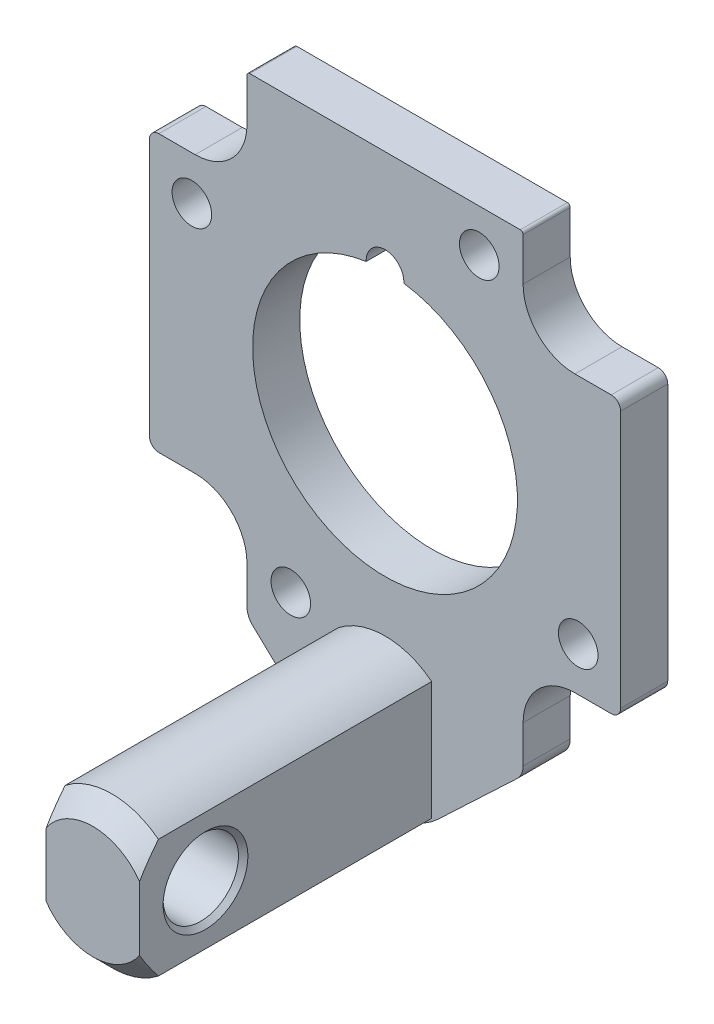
ISO-10303-21;
HEADER;
FILE_DESCRIPTION(('STEP AP214'),'2;1');
FILE_NAME('part.step','',(''),(''),'','','');
FILE_SCHEMA(('AUTOMOTIVE_DESIGN { 1 0 10303 214 1 1 1 1 }'));
ENDSEC;
DATA;
#1=APPLICATION_CONTEXT('core data for automotive mechanical design processes');
#2=APPLICATION_PROTOCOL_DEFINITION('international standard','automotive_design',2000,#1);
#3=PRODUCT_CONTEXT('',#1,'mechanical');
#4=PRODUCT('Part','Part','',(#3));
#5=PRODUCT_RELATED_PRODUCT_CATEGORY('part','',(#4));
#6=PRODUCT_DEFINITION_FORMATION('','',#4);
#7=PRODUCT_DEFINITION_CONTEXT('part definition',#1,'design');
#8=PRODUCT_DEFINITION('design','',#6,#7);
#9=PRODUCT_DEFINITION_SHAPE('','',#8);
#10=(LENGTH_UNIT() NAMED_UNIT(*) SI_UNIT(.MILLI.,.METRE.));
#11=(NAMED_UNIT(*) PLANE_ANGLE_UNIT() SI_UNIT($,.RADIAN.));
#12=(NAMED_UNIT(*) SI_UNIT($,.STERADIAN.) SOLID_ANGLE_UNIT());
#13=UNCERTAINTY_MEASURE_WITH_UNIT(LENGTH_MEASURE(1.E-05),#10,'distance_accuracy_value','');
#14=(GEOMETRIC_REPRESENTATION_CONTEXT(3) GLOBAL_UNCERTAINTY_ASSIGNED_CONTEXT((#13)) GLOBAL_UNIT_ASSIGNED_CONTEXT((#10,
#11,#12)) REPRESENTATION_CONTEXT('',''));
#15=CARTESIAN_POINT('',(0.,0.,0.));
#16=DIRECTION('',(0.,0.,1.));
#17=DIRECTION('',(1.,0.,0.));
#18=AXIS2_PLACEMENT_3D('',#15,#16,#17);
#19=CARTESIAN_POINT('',(-20.15,20.15,0.));
#20=DIRECTION('',(0.,0.,1.));
#21=DIRECTION('',(1.,0.,0.));
#22=AXIS2_PLACEMENT_3D('',#19,#20,#21);
#23=PLANE('',#22);
#24=DIRECTION('',(0.726541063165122,0.687123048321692,0.));
#25=VECTOR('',#24,1.);
#26=CARTESIAN_POINT('',(5.66876514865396,-33.4939637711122,0.));
#27=LINE('',#26,#25);
#28=CARTESIAN_POINT('',(5.66876514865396,-33.4939637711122,0.));
#29=VERTEX_POINT('',#28);
#30=CARTESIAN_POINT('',(14.0242460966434,-25.5918040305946,0.));
#31=VERTEX_POINT('',#30);
#32=EDGE_CURVE('E428',#29,#31,#27,.T.);
#33=ORIENTED_EDGE('',*,*,#32,.T.);
#34=CARTESIAN_POINT('',(12.65,-24.1387219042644,0.));
#35=DIRECTION('',(0.,0.,1.));
#36=DIRECTION('',(1.,0.,0.));
#37=AXIS2_PLACEMENT_3D('',#34,#35,#36);
#38=CIRCLE('',#37,2.);
#39=CARTESIAN_POINT('',(14.65,-24.1387219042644,0.));
#40=VERTEX_POINT('',#39);
#41=EDGE_CURVE('E537',#31,#40,#38,.T.);
#42=ORIENTED_EDGE('',*,*,#41,.T.);
#43=DIRECTION('',(0.,1.,0.));
#44=VECTOR('',#43,1.);
#45=CARTESIAN_POINT('',(14.65,-20.15,0.));
#46=LINE('',#45,#44);
#47=CARTESIAN_POINT('',(14.65,-20.15,0.));
#48=VERTEX_POINT('',#47);
#49=EDGE_CURVE('E431',#40,#48,#46,.T.);
#50=ORIENTED_EDGE('',*,*,#49,.T.);
#51=CARTESIAN_POINT('',(20.15,-20.15,0.));
#52=DIRECTION('',(0.,0.,-1.));
#53=DIRECTION('',(1.,0.,0.));
#54=AXIS2_PLACEMENT_3D('',#51,#52,#53);
#55=CIRCLE('',#54,5.5);
#56=CARTESIAN_POINT('',(20.15,-14.65,0.));
#57=VERTEX_POINT('',#56);
#58=EDGE_CURVE('E433',#48,#57,#55,.T.);
#59=ORIENTED_EDGE('',*,*,#58,.T.);
#60=DIRECTION('',(1.,0.,0.));
#61=VECTOR('',#60,1.);
#62=CARTESIAN_POINT('',(20.15,-14.65,0.));
#63=LINE('',#62,#61);
#64=CARTESIAN_POINT('',(24.,-14.65,0.));
#65=VERTEX_POINT('',#64);
#66=EDGE_CURVE('E436',#57,#65,#63,.T.);
#67=ORIENTED_EDGE('',*,*,#66,.T.);
#68=CARTESIAN_POINT('',(24.,-13.65,0.));
#69=DIRECTION('',(0.,0.,1.));
#70=DIRECTION('',(1.,0.,0.));
#71=AXIS2_PLACEMENT_3D('',#68,#69,#70);
#72=CIRCLE('',#71,1.);
#73=CARTESIAN_POINT('',(25.,-13.65,0.));
#74=VERTEX_POINT('',#73);
#75=EDGE_CURVE('E487',#65,#74,#72,.T.);
#76=ORIENTED_EDGE('',*,*,#75,.T.);
#77=DIRECTION('',(0.,1.,0.));
#78=VECTOR('',#77,1.);
#79=CARTESIAN_POINT('',(25.,14.65,0.));
#80=LINE('',#79,#78);
#81=CARTESIAN_POINT('',(25.,13.65,0.));
#82=VERTEX_POINT('',#81);
#83=EDGE_CURVE('E439',#74,#82,#80,.T.);
#84=ORIENTED_EDGE('',*,*,#83,.T.);
#85=CARTESIAN_POINT('',(24.,13.65,0.));
#86=DIRECTION('',(0.,0.,1.));
#87=DIRECTION('',(1.,0.,0.));
#88=AXIS2_PLACEMENT_3D('',#85,#86,#87);
#89=CIRCLE('',#88,1.);
#90=CARTESIAN_POINT('',(24.,14.65,0.));
#91=VERTEX_POINT('',#90);
#92=EDGE_CURVE('E489',#82,#91,#89,.T.);
#93=ORIENTED_EDGE('',*,*,#92,.T.);
#94=DIRECTION('',(-1.,0.,0.));
#95=VECTOR('',#94,1.);
#96=CARTESIAN_POINT('',(20.15,14.65,0.));
#97=LINE('',#96,#95);
#98=CARTESIAN_POINT('',(20.15,14.65,0.));
#99=VERTEX_POINT('',#98);
#100=EDGE_CURVE('E442',#91,#99,#97,.T.);
#101=ORIENTED_EDGE('',*,*,#100,.T.);
#102=CARTESIAN_POINT('',(20.15,20.15,0.));
#103=DIRECTION('',(0.,0.,-1.));
#104=DIRECTION('',(-1.,0.,0.));
#105=AXIS2_PLACEMENT_3D('',#102,#103,#104);
#106=CIRCLE('',#105,5.5);
#107=CARTESIAN_POINT('',(14.65,20.15,0.));
#108=VERTEX_POINT('',#107);
#109=EDGE_CURVE('E444',#99,#108,#106,.T.);
#110=ORIENTED_EDGE('',*,*,#109,.T.);
#111=DIRECTION('',(0.,1.,0.));
#112=VECTOR('',#111,1.);
#113=CARTESIAN_POINT('',(14.65,20.15,0.));
#114=LINE('',#113,#112);
#115=CARTESIAN_POINT('',(14.65,24.7,0.));
#116=VERTEX_POINT('',#115);
#117=EDGE_CURVE('E447',#108,#116,#114,.T.);
#118=ORIENTED_EDGE('',*,*,#117,.T.);
#119=CARTESIAN_POINT('',(14.35,24.7,0.));
#120=DIRECTION('',(0.,0.,1.));
#121=DIRECTION('',(1.,0.,0.));
#122=AXIS2_PLACEMENT_3D('',#119,#120,#121);
#123=CIRCLE('',#122,0.3);
#124=CARTESIAN_POINT('',(14.35,25.,0.));
#125=VERTEX_POINT('',#124);
#126=EDGE_CURVE('E519',#116,#125,#123,.T.);
#127=ORIENTED_EDGE('',*,*,#126,.T.);
#128=DIRECTION('',(-1.,0.,0.));
#129=VECTOR('',#128,1.);
#130=CARTESIAN_POINT('',(-14.65,25.,0.));
#131=LINE('',#130,#129);
#132=CARTESIAN_POINT('',(-14.35,25.,0.));
#133=VERTEX_POINT('',#132);
#134=EDGE_CURVE('E450',#125,#133,#131,.T.);
#135=ORIENTED_EDGE('',*,*,#134,.T.);
#136=CARTESIAN_POINT('',(-14.35,24.7,0.));
#137=DIRECTION('',(0.,0.,1.));
#138=DIRECTION('',(1.,0.,0.));
#139=AXIS2_PLACEMENT_3D('',#136,#137,#138);
#140=CIRCLE('',#139,0.3);
#141=CARTESIAN_POINT('',(-14.65,24.7,0.));
#142=VERTEX_POINT('',#141);
#143=EDGE_CURVE('E517',#133,#142,#140,.T.);
#144=ORIENTED_EDGE('',*,*,#143,.T.);
#145=DIRECTION('',(0.,-1.,0.));
#146=VECTOR('',#145,1.);
#147=CARTESIAN_POINT('',(-14.65,20.15,0.));
#148=LINE('',#147,#146);
#149=CARTESIAN_POINT('',(-14.65,20.15,0.));
#150=VERTEX_POINT('',#149);
#151=EDGE_CURVE('E361',#142,#150,#148,.T.);
#152=ORIENTED_EDGE('',*,*,#151,.T.);
#153=CARTESIAN_POINT('',(-20.15,20.15,0.));
#154=DIRECTION('',(0.,0.,-1.));
#155=DIRECTION('',(1.,0.,0.));
#156=AXIS2_PLACEMENT_3D('',#153,#154,#155);
#157=CIRCLE('',#156,5.5);
#158=CARTESIAN_POINT('',(-20.15,14.65,0.));
#159=VERTEX_POINT('',#158);
#160=EDGE_CURVE('E354',#150,#159,#157,.T.);
#161=ORIENTED_EDGE('',*,*,#160,.T.);
#162=DIRECTION('',(-1.,0.,0.));
#163=VECTOR('',#162,1.);
#164=CARTESIAN_POINT('',(-20.15,14.65,0.));
#165=LINE('',#164,#163);
#166=CARTESIAN_POINT('',(-24.,14.65,0.));
#167=VERTEX_POINT('',#166);
#168=EDGE_CURVE('E409',#159,#167,#165,.T.);
#169=ORIENTED_EDGE('',*,*,#168,.T.);
#170=CARTESIAN_POINT('',(-24.,13.65,0.));
#171=DIRECTION('',(0.,0.,1.));
#172=DIRECTION('',(1.,0.,0.));
#173=AXIS2_PLACEMENT_3D('',#170,#171,#172);
#174=CIRCLE('',#173,1.);
#175=CARTESIAN_POINT('',(-25.,13.65,0.));
#176=VERTEX_POINT('',#175);
#177=EDGE_CURVE('E483',#167,#176,#174,.T.);
#178=ORIENTED_EDGE('',*,*,#177,.T.);
#179=DIRECTION('',(0.,-1.,0.));
#180=VECTOR('',#179,1.);
#181=CARTESIAN_POINT('',(-25.,14.65,0.));
#182=LINE('',#181,#180);
#183=CARTESIAN_POINT('',(-25.,-13.65,0.));
#184=VERTEX_POINT('',#183);
#185=EDGE_CURVE('E412',#176,#184,#182,.T.);
#186=ORIENTED_EDGE('',*,*,#185,.T.);
#187=CARTESIAN_POINT('',(-24.,-13.65,0.));
#188=DIRECTION('',(0.,0.,1.));
#189=DIRECTION('',(1.,0.,0.));
#190=AXIS2_PLACEMENT_3D('',#187,#188,#189);
#191=CIRCLE('',#190,1.);
#192=CARTESIAN_POINT('',(-24.,-14.65,0.));
#193=VERTEX_POINT('',#192);
#194=EDGE_CURVE('E485',#184,#193,#191,.T.);
#195=ORIENTED_EDGE('',*,*,#194,.T.);
#196=DIRECTION('',(1.,0.,0.));
#197=VECTOR('',#196,1.);
#198=CARTESIAN_POINT('',(-20.15,-14.65,0.));
#199=LINE('',#198,#197);
#200=CARTESIAN_POINT('',(-20.15,-14.65,0.));
#201=VERTEX_POINT('',#200);
#202=EDGE_CURVE('E415',#193,#201,#199,.T.);
#203=ORIENTED_EDGE('',*,*,#202,.T.);
#204=CARTESIAN_POINT('',(-20.15,-20.15,0.));
#205=DIRECTION('',(0.,0.,-1.));
#206=DIRECTION('',(-1.,0.,0.));
#207=AXIS2_PLACEMENT_3D('',#204,#205,#206);
#208=CIRCLE('',#207,5.5);
#209=CARTESIAN_POINT('',(-14.65,-20.15,0.));
#210=VERTEX_POINT('',#209);
#211=EDGE_CURVE('E417',#201,#210,#208,.T.);
#212=ORIENTED_EDGE('',*,*,#211,.T.);
#213=DIRECTION('',(0.,-1.,0.));
#214=VECTOR('',#213,1.);
#215=CARTESIAN_POINT('',(-14.65,-20.15,0.));
#216=LINE('',#215,#214);
#217=CARTESIAN_POINT('',(-14.65,-24.1387219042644,0.));
#218=VERTEX_POINT('',#217);
#219=EDGE_CURVE('E420',#210,#218,#216,.T.);
#220=ORIENTED_EDGE('',*,*,#219,.T.);
#221=CARTESIAN_POINT('',(-12.65,-24.1387219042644,0.));
#222=DIRECTION('',(0.,0.,1.));
#223=DIRECTION('',(1.,0.,0.));
#224=AXIS2_PLACEMENT_3D('',#221,#222,#223);
#225=CIRCLE('',#224,2.);
#226=CARTESIAN_POINT('',(-14.0242460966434,-25.5918040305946,0.));
#227=VERTEX_POINT('',#226);
#228=EDGE_CURVE('E535',#218,#227,#225,.T.);
#229=ORIENTED_EDGE('',*,*,#228,.T.);
#230=DIRECTION('',(0.726541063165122,-0.687123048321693,0.));
#231=VECTOR('',#230,1.);
#232=CARTESIAN_POINT('',(-14.65,-25.,0.));
#233=LINE('',#232,#231);
#234=CARTESIAN_POINT('',(-5.66876514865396,-33.4939637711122,0.));
#235=VERTEX_POINT('',#234);
#236=EDGE_CURVE('E423',#227,#235,#233,.T.);
#237=ORIENTED_EDGE('',*,*,#236,.T.);
#238=CARTESIAN_POINT('',(0.,-27.5,0.));
#239=DIRECTION('',(0.,0.,1.));
#240=DIRECTION('',(1.,0.,0.));
#241=AXIS2_PLACEMENT_3D('',#238,#239,#240);
#242=CIRCLE('',#241,8.25);
#243=EDGE_CURVE('E425',#235,#29,#242,.T.);
#244=ORIENTED_EDGE('',*,*,#243,.T.);
#245=EDGE_LOOP('',(#33,#42,#50,#59,#67,#76,#84,#93,#101,#110,#118,#127,#135,#144,#152,#161,#169,
#178,#186,#195,#203,#212,#220,#229,#237,#244));
#246=FACE_BOUND('',#245,.T.);
#247=CARTESIAN_POINT('',(20.5,-10.,0.));
#248=DIRECTION('',(0.,0.,1.));
#249=DIRECTION('',(1.,0.,0.));
#250=AXIS2_PLACEMENT_3D('',#247,#248,#249);
#251=CIRCLE('',#250,2.1);
#252=CARTESIAN_POINT('',(22.6,-10.,0.));
#253=VERTEX_POINT('',#252);
#254=EDGE_CURVE('E348',#253,#253,#251,.T.);
#255=ORIENTED_EDGE('',*,*,#254,.F.);
#256=EDGE_LOOP('',(#255));
#257=FACE_BOUND('',#256,.T.);
#258=CARTESIAN_POINT('',(-10.,-20.5,0.));
#259=DIRECTION('',(0.,0.,1.));
#260=DIRECTION('',(1.,0.,0.));
#261=AXIS2_PLACEMENT_3D('',#258,#259,#260);
#262=CIRCLE('',#261,2.1);
#263=CARTESIAN_POINT('',(-7.9,-20.5,0.));
#264=VERTEX_POINT('',#263);
#265=EDGE_CURVE('E342',#264,#264,#262,.T.);
#266=ORIENTED_EDGE('',*,*,#265,.F.);
#267=EDGE_LOOP('',(#266));
#268=FACE_BOUND('',#267,.T.);
#269=CARTESIAN_POINT('',(-20.5,10.0000000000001,0.));
#270=DIRECTION('',(0.,0.,1.));
#271=DIRECTION('',(1.,0.,0.));
#272=AXIS2_PLACEMENT_3D('',#269,#270,#271);
#273=CIRCLE('',#272,2.1);
#274=CARTESIAN_POINT('',(-18.4,10.0000000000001,0.));
#275=VERTEX_POINT('',#274);
#276=EDGE_CURVE('E336',#275,#275,#273,.T.);
#277=ORIENTED_EDGE('',*,*,#276,.F.);
#278=EDGE_LOOP('',(#277));
#279=FACE_BOUND('',#278,.T.);
#280=CARTESIAN_POINT('',(10.0000000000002,20.5,0.));
#281=DIRECTION('',(0.,0.,1.));
#282=DIRECTION('',(1.,0.,0.));
#283=AXIS2_PLACEMENT_3D('',#280,#281,#282);
#284=CIRCLE('',#283,2.1);
#285=CARTESIAN_POINT('',(12.1000000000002,20.5,0.));
#286=VERTEX_POINT('',#285);
#287=EDGE_CURVE('E330',#286,#286,#284,.T.);
#288=ORIENTED_EDGE('',*,*,#287,.F.);
#289=EDGE_LOOP('',(#288));
#290=FACE_BOUND('',#289,.T.);
#291=CARTESIAN_POINT('',(0.,14.,0.));
#292=DIRECTION('',(0.,0.,1.));
#293=DIRECTION('',(1.,0.,0.));
#294=AXIS2_PLACEMENT_3D('',#291,#292,#293);
#295=CIRCLE('',#294,2.);
#296=CARTESIAN_POINT('',(1.99784737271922,13.9072321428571,0.));
#297=VERTEX_POINT('',#296);
#298=CARTESIAN_POINT('',(-1.99784737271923,13.9072321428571,0.));
#299=VERTEX_POINT('',#298);
#300=EDGE_CURVE('E316',#297,#299,#295,.T.);
#301=ORIENTED_EDGE('',*,*,#300,.F.);
#302=CARTESIAN_POINT('',(0.,0.,0.));
#303=DIRECTION('',(0.,0.,1.));
#304=DIRECTION('',(1.,0.,0.));
#305=AXIS2_PLACEMENT_3D('',#302,#303,#304);
#306=CIRCLE('',#305,14.05);
#307=EDGE_CURVE('E321',#299,#297,#306,.T.);
#308=ORIENTED_EDGE('',*,*,#307,.F.);
#309=EDGE_LOOP('',(#301,#308));
#310=FACE_BOUND('',#309,.T.);
#311=CARTESIAN_POINT('',(0.,-27.5,0.));
#312=DIRECTION('',(0.,0.,1.));
#313=DIRECTION('',(1.,0.,0.));
#314=AXIS2_PLACEMENT_3D('',#311,#312,#313);
#315=CIRCLE('',#314,8.);
#316=CARTESIAN_POINT('',(-4.95,-33.7847036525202,0.));
#317=VERTEX_POINT('',#316);
#318=CARTESIAN_POINT('',(4.95,-33.7847036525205,0.));
#319=VERTEX_POINT('',#318);
#320=EDGE_CURVE('E247',#317,#319,#315,.T.);
#321=ORIENTED_EDGE('',*,*,#320,.F.);
#322=DIRECTION('',(0.,-1.,0.));
#323=VECTOR('',#322,1.);
#324=CARTESIAN_POINT('',(-4.95,-19.5,0.));
#325=LINE('',#324,#323);
#326=CARTESIAN_POINT('',(-4.94999999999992,-21.2152963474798,0.));
#327=VERTEX_POINT('',#326);
#328=EDGE_CURVE('E253',#327,#317,#325,.T.);
#329=ORIENTED_EDGE('',*,*,#328,.F.);
#330=CARTESIAN_POINT('',(0.,-27.5,0.));
#331=DIRECTION('',(0.,0.,1.));
#332=DIRECTION('',(1.,0.,0.));
#333=AXIS2_PLACEMENT_3D('',#330,#331,#332);
#334=CIRCLE('',#333,8.);
#335=CARTESIAN_POINT('',(4.95,-21.2152963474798,0.));
#336=VERTEX_POINT('',#335);
#337=EDGE_CURVE('E237',#336,#327,#334,.T.);
#338=ORIENTED_EDGE('',*,*,#337,.F.);
#339=DIRECTION('',(0.,1.,0.));
#340=VECTOR('',#339,1.);
#341=CARTESIAN_POINT('',(4.95,-19.5,0.));
#342=LINE('',#341,#340);
#343=EDGE_CURVE('E314',#319,#336,#342,.T.);
#344=ORIENTED_EDGE('',*,*,#343,.F.);
#345=EDGE_LOOP('',(#321,#329,#338,#344));
#346=FACE_BOUND('',#345,.T.);
#347=ADVANCED_FACE('F15',(#246,#257,#268,#279,#290,#310,#346),#23,.T.);
#348=CARTESIAN_POINT('',(-20.15,20.15,-5.));
#349=DIRECTION('',(0.,0.,1.));
#350=DIRECTION('',(1.,0.,0.));
#351=AXIS2_PLACEMENT_3D('',#348,#349,#350);
#352=CYLINDRICAL_SURFACE('',#351,5.5);
#353=ORIENTED_EDGE('',*,*,#160,.F.);
#354=DIRECTION('',(0.,0.,1.));
#355=VECTOR('',#354,1.);
#356=CARTESIAN_POINT('',(-14.65,20.15,-5.));
#357=LINE('',#356,#355);
#358=CARTESIAN_POINT('',(-14.65,20.15,-5.));
#359=VERTEX_POINT('',#358);
#360=EDGE_CURVE('E454',#359,#150,#357,.T.);
#361=ORIENTED_EDGE('',*,*,#360,.F.);
#362=CARTESIAN_POINT('',(-20.15,20.15,-5.));
#363=DIRECTION('',(0.,0.,-1.));
#364=DIRECTION('',(1.,0.,0.));
#365=AXIS2_PLACEMENT_3D('',#362,#363,#364);
#366=CIRCLE('',#365,5.5);
#367=CARTESIAN_POINT('',(-20.15,14.65,-5.));
#368=VERTEX_POINT('',#367);
#369=EDGE_CURVE('E357',#359,#368,#366,.T.);
#370=ORIENTED_EDGE('',*,*,#369,.T.);
#371=DIRECTION('',(0.,0.,1.));
#372=VECTOR('',#371,1.);
#373=CARTESIAN_POINT('',(-20.15,14.65,-5.));
#374=LINE('',#373,#372);
#375=EDGE_CURVE('E406',#368,#159,#374,.T.);
#376=ORIENTED_EDGE('',*,*,#375,.T.);
#377=EDGE_LOOP('',(#353,#361,#370,#376));
#378=FACE_BOUND('',#377,.T.);
#379=ADVANCED_FACE('F585',(#378),#352,.F.);
#380=CARTESIAN_POINT('',(-14.65,20.15,-5.));
#381=DIRECTION('',(-1.,0.,0.));
#382=DIRECTION('',(0.,-1.,0.));
#383=AXIS2_PLACEMENT_3D('',#380,#381,#382);
#384=PLANE('',#383);
#385=ORIENTED_EDGE('',*,*,#151,.F.);
#386=DIRECTION('',(0.,0.,1.));
#387=VECTOR('',#386,1.);
#388=CARTESIAN_POINT('',(-14.65,24.7,-5.));
#389=LINE('',#388,#387);
#390=CARTESIAN_POINT('',(-14.65,24.7,-5.));
#391=VERTEX_POINT('',#390);
#392=EDGE_CURVE('E530',#142,#391,#389,.F.);
#393=ORIENTED_EDGE('',*,*,#392,.T.);
#394=DIRECTION('',(0.,-1.,0.));
#395=VECTOR('',#394,1.);
#396=CARTESIAN_POINT('',(-14.65,20.15,-5.));
#397=LINE('',#396,#395);
#398=EDGE_CURVE('E404',#391,#359,#397,.T.);
#399=ORIENTED_EDGE('',*,*,#398,.T.);
#400=ORIENTED_EDGE('',*,*,#360,.T.);
#401=EDGE_LOOP('',(#385,#393,#399,#400));
#402=FACE_BOUND('',#401,.T.);
#403=ADVANCED_FACE('F588',(#402),#384,.T.);
#404=CARTESIAN_POINT('',(-14.65,25.,-5.));
#405=DIRECTION('',(0.,1.,0.));
#406=DIRECTION('',(0.,0.,1.));
#407=AXIS2_PLACEMENT_3D('',#404,#405,#406);
#408=PLANE('',#407);
#409=ORIENTED_EDGE('',*,*,#134,.F.);
#410=DIRECTION('',(0.,0.,1.));
#411=VECTOR('',#410,1.);
#412=CARTESIAN_POINT('',(14.35,25.,-5.));
#413=LINE('',#412,#411);
#414=CARTESIAN_POINT('',(14.35,25.,-5.));
#415=VERTEX_POINT('',#414);
#416=EDGE_CURVE('E524',#125,#415,#413,.F.);
#417=ORIENTED_EDGE('',*,*,#416,.T.);
#418=DIRECTION('',(-1.,0.,0.));
#419=VECTOR('',#418,1.);
#420=CARTESIAN_POINT('',(-14.65,25.,-5.));
#421=LINE('',#420,#419);
#422=CARTESIAN_POINT('',(-14.35,25.,-5.));
#423=VERTEX_POINT('',#422);
#424=EDGE_CURVE('E401',#415,#423,#421,.T.);
#425=ORIENTED_EDGE('',*,*,#424,.T.);
#426=DIRECTION('',(0.,0.,1.));
#427=VECTOR('',#426,1.);
#428=CARTESIAN_POINT('',(-14.35,25.,-5.));
#429=LINE('',#428,#427);
#430=EDGE_CURVE('E521',#423,#133,#429,.T.);
#431=ORIENTED_EDGE('',*,*,#430,.T.);
#432=EDGE_LOOP('',(#409,#417,#425,#431));
#433=FACE_BOUND('',#432,.T.);
#434=ADVANCED_FACE('F597',(#433),#408,.T.);
#435=CARTESIAN_POINT('',(14.65,20.15,-5.));
#436=DIRECTION('',(1.,0.,0.));
#437=DIRECTION('',(0.,1.,0.));
#438=AXIS2_PLACEMENT_3D('',#435,#436,#437);
#439=PLANE('',#438);
#440=DIRECTION('',(0.,1.,0.));
#441=VECTOR('',#440,1.);
#442=CARTESIAN_POINT('',(14.65,20.15,-5.));
#443=LINE('',#442,#441);
#444=CARTESIAN_POINT('',(14.65,20.15,-5.));
#445=VERTEX_POINT('',#444);
#446=CARTESIAN_POINT('',(14.65,24.7,-5.));
#447=VERTEX_POINT('',#446);
#448=EDGE_CURVE('E398',#445,#447,#443,.T.);
#449=ORIENTED_EDGE('',*,*,#448,.T.);
#450=DIRECTION('',(0.,0.,1.));
#451=VECTOR('',#450,1.);
#452=CARTESIAN_POINT('',(14.65,24.7,-5.));
#453=LINE('',#452,#451);
#454=EDGE_CURVE('E514',#447,#116,#453,.T.);
#455=ORIENTED_EDGE('',*,*,#454,.T.);
#456=ORIENTED_EDGE('',*,*,#117,.F.);
#457=DIRECTION('',(0.,0.,1.));
#458=VECTOR('',#457,1.);
#459=CARTESIAN_POINT('',(14.65,20.15,-5.));
#460=LINE('',#459,#458);
#461=EDGE_CURVE('E458',#445,#108,#460,.T.);
#462=ORIENTED_EDGE('',*,*,#461,.F.);
#463=EDGE_LOOP('',(#449,#455,#456,#462));
#464=FACE_BOUND('',#463,.T.);
#465=ADVANCED_FACE('F605',(#464),#439,.T.);
#466=CARTESIAN_POINT('',(20.15,20.15,-5.));
#467=DIRECTION('',(0.,0.,1.));
#468=DIRECTION('',(1.,0.,0.));
#469=AXIS2_PLACEMENT_3D('',#466,#467,#468);
#470=CYLINDRICAL_SURFACE('',#469,5.5);
#471=ORIENTED_EDGE('',*,*,#109,.F.);
#472=DIRECTION('',(0.,0.,1.));
#473=VECTOR('',#472,1.);
#474=CARTESIAN_POINT('',(20.15,14.65,-5.));
#475=LINE('',#474,#473);
#476=CARTESIAN_POINT('',(20.15,14.65,-5.));
#477=VERTEX_POINT('',#476);
#478=EDGE_CURVE('E460',#477,#99,#475,.T.);
#479=ORIENTED_EDGE('',*,*,#478,.F.);
#480=CARTESIAN_POINT('',(20.15,20.15,-5.));
#481=DIRECTION('',(0.,0.,-1.));
#482=DIRECTION('',(-1.,0.,0.));
#483=AXIS2_PLACEMENT_3D('',#480,#481,#482);
#484=CIRCLE('',#483,5.5);
#485=EDGE_CURVE('E395',#477,#445,#484,.T.);
#486=ORIENTED_EDGE('',*,*,#485,.T.);
#487=ORIENTED_EDGE('',*,*,#461,.T.);
#488=EDGE_LOOP('',(#471,#479,#486,#487));
#489=FACE_BOUND('',#488,.T.);
#490=ADVANCED_FACE('F612',(#489),#470,.F.);
#491=CARTESIAN_POINT('',(20.15,14.65,-5.));
#492=DIRECTION('',(0.,1.,0.));
#493=DIRECTION('',(0.,0.,1.));
#494=AXIS2_PLACEMENT_3D('',#491,#492,#493);
#495=PLANE('',#494);
#496=ORIENTED_EDGE('',*,*,#100,.F.);
#497=DIRECTION('',(0.,0.,1.));
#498=VECTOR('',#497,1.);
#499=CARTESIAN_POINT('',(24.,14.65,-5.));
#500=LINE('',#499,#498);
#501=CARTESIAN_POINT('',(24.,14.65,-5.));
#502=VERTEX_POINT('',#501);
#503=EDGE_CURVE('E491',#91,#502,#500,.F.);
#504=ORIENTED_EDGE('',*,*,#503,.T.);
#505=DIRECTION('',(-1.,0.,0.));
#506=VECTOR('',#505,1.);
#507=CARTESIAN_POINT('',(20.15,14.65,-5.));
#508=LINE('',#507,#506);
#509=EDGE_CURVE('E393',#502,#477,#508,.T.);
#510=ORIENTED_EDGE('',*,*,#509,.T.);
#511=ORIENTED_EDGE('',*,*,#478,.T.);
#512=EDGE_LOOP('',(#496,#504,#510,#511));
#513=FACE_BOUND('',#512,.T.);
#514=ADVANCED_FACE('F615',(#513),#495,.T.);
#515=CARTESIAN_POINT('',(25.,14.65,-5.));
#516=DIRECTION('',(1.,0.,0.));
#517=DIRECTION('',(0.,0.,-1.));
#518=AXIS2_PLACEMENT_3D('',#515,#516,#517);
#519=PLANE('',#518);
#520=DIRECTION('',(0.,1.,0.));
#521=VECTOR('',#520,1.);
#522=CARTESIAN_POINT('',(25.,14.65,-5.));
#523=LINE('',#522,#521);
#524=CARTESIAN_POINT('',(25.,-13.65,-5.));
#525=VERTEX_POINT('',#524);
#526=CARTESIAN_POINT('',(25.,13.65,-5.));
#527=VERTEX_POINT('',#526);
#528=EDGE_CURVE('E390',#525,#527,#523,.T.);
#529=ORIENTED_EDGE('',*,*,#528,.T.);
#530=DIRECTION('',(0.,0.,1.));
#531=VECTOR('',#530,1.);
#532=CARTESIAN_POINT('',(25.,13.65,-5.));
#533=LINE('',#532,#531);
#534=EDGE_CURVE('E480',#527,#82,#533,.T.);
#535=ORIENTED_EDGE('',*,*,#534,.T.);
#536=ORIENTED_EDGE('',*,*,#83,.F.);
#537=DIRECTION('',(0.,0.,1.));
#538=VECTOR('',#537,1.);
#539=CARTESIAN_POINT('',(25.,-13.65,-5.));
#540=LINE('',#539,#538);
#541=EDGE_CURVE('E457',#74,#525,#540,.F.);
#542=ORIENTED_EDGE('',*,*,#541,.T.);
#543=EDGE_LOOP('',(#529,#535,#536,#542));
#544=FACE_BOUND('',#543,.T.);
#545=ADVANCED_FACE('F624',(#544),#519,.T.);
#546=CARTESIAN_POINT('',(20.15,-14.65,-5.));
#547=DIRECTION('',(0.,-1.,0.));
#548=DIRECTION('',(0.,0.,-1.));
#549=AXIS2_PLACEMENT_3D('',#546,#547,#548);
#550=PLANE('',#549);
#551=DIRECTION('',(1.,0.,0.));
#552=VECTOR('',#551,1.);
#553=CARTESIAN_POINT('',(20.15,-14.65,-5.));
#554=LINE('',#553,#552);
#555=CARTESIAN_POINT('',(20.15,-14.65,-5.));
#556=VERTEX_POINT('',#555);
#557=CARTESIAN_POINT('',(24.,-14.65,-5.));
#558=VERTEX_POINT('',#557);
#559=EDGE_CURVE('E387',#556,#558,#554,.T.);
#560=ORIENTED_EDGE('',*,*,#559,.T.);
#561=DIRECTION('',(0.,0.,1.));
#562=VECTOR('',#561,1.);
#563=CARTESIAN_POINT('',(24.,-14.65,-5.));
#564=LINE('',#563,#562);
#565=EDGE_CURVE('E501',#558,#65,#564,.T.);
#566=ORIENTED_EDGE('',*,*,#565,.T.);
#567=ORIENTED_EDGE('',*,*,#66,.F.);
#568=DIRECTION('',(0.,0.,1.));
#569=VECTOR('',#568,1.);
#570=CARTESIAN_POINT('',(20.15,-14.65,-5.));
#571=LINE('',#570,#569);
#572=EDGE_CURVE('E463',#556,#57,#571,.T.);
#573=ORIENTED_EDGE('',*,*,#572,.F.);
#574=EDGE_LOOP('',(#560,#566,#567,#573));
#575=FACE_BOUND('',#574,.T.);
#576=ADVANCED_FACE('F632',(#575),#550,.T.);
#577=CARTESIAN_POINT('',(20.15,-20.15,-5.));
#578=DIRECTION('',(0.,0.,1.));
#579=DIRECTION('',(1.,0.,0.));
#580=AXIS2_PLACEMENT_3D('',#577,#578,#579);
#581=CYLINDRICAL_SURFACE('',#580,5.5);
#582=ORIENTED_EDGE('',*,*,#58,.F.);
#583=DIRECTION('',(0.,0.,1.));
#584=VECTOR('',#583,1.);
#585=CARTESIAN_POINT('',(14.65,-20.15,-5.));
#586=LINE('',#585,#584);
#587=CARTESIAN_POINT('',(14.65,-20.15,-5.));
#588=VERTEX_POINT('',#587);
#589=EDGE_CURVE('E465',#588,#48,#586,.T.);
#590=ORIENTED_EDGE('',*,*,#589,.F.);
#591=CARTESIAN_POINT('',(20.15,-20.15,-5.));
#592=DIRECTION('',(0.,0.,-1.));
#593=DIRECTION('',(1.,0.,0.));
#594=AXIS2_PLACEMENT_3D('',#591,#592,#593);
#595=CIRCLE('',#594,5.5);
#596=EDGE_CURVE('E384',#588,#556,#595,.T.);
#597=ORIENTED_EDGE('',*,*,#596,.T.);
#598=ORIENTED_EDGE('',*,*,#572,.T.);
#599=EDGE_LOOP('',(#582,#590,#597,#598));
#600=FACE_BOUND('',#599,.T.);
#601=ADVANCED_FACE('F638',(#600),#581,.F.);
#602=CARTESIAN_POINT('',(14.65,-20.15,-5.));
#603=DIRECTION('',(1.,0.,0.));
#604=DIRECTION('',(0.,1.,0.));
#605=AXIS2_PLACEMENT_3D('',#602,#603,#604);
#606=PLANE('',#605);
#607=ORIENTED_EDGE('',*,*,#49,.F.);
#608=DIRECTION('',(0.,0.,1.));
#609=VECTOR('',#608,1.);
#610=CARTESIAN_POINT('',(14.65,-24.1387219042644,-5.));
#611=LINE('',#610,#609);
#612=CARTESIAN_POINT('',(14.65,-24.1387219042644,-5.));
#613=VERTEX_POINT('',#612);
#614=EDGE_CURVE('E539',#40,#613,#611,.F.);
#615=ORIENTED_EDGE('',*,*,#614,.T.);
#616=DIRECTION('',(0.,1.,0.));
#617=VECTOR('',#616,1.);
#618=CARTESIAN_POINT('',(14.65,-20.15,-5.));
#619=LINE('',#618,#617);
#620=EDGE_CURVE('E382',#613,#588,#619,.T.);
#621=ORIENTED_EDGE('',*,*,#620,.T.);
#622=ORIENTED_EDGE('',*,*,#589,.T.);
#623=EDGE_LOOP('',(#607,#615,#621,#622));
#624=FACE_BOUND('',#623,.T.);
#625=ADVANCED_FACE('F641',(#624),#606,.T.);
#626=CARTESIAN_POINT('',(5.66876514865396,-33.4939637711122,-5.));
#627=DIRECTION('',(0.687123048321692,-0.726541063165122,0.));
#628=DIRECTION('',(0.726541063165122,0.687123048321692,0.));
#629=AXIS2_PLACEMENT_3D('',#626,#627,#628);
#630=PLANE('',#629);
#631=DIRECTION('',(0.726541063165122,0.687123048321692,0.));
#632=VECTOR('',#631,1.);
#633=CARTESIAN_POINT('',(5.66876514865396,-33.4939637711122,-5.));
#634=LINE('',#633,#632);
#635=CARTESIAN_POINT('',(5.66876514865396,-33.4939637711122,-5.));
#636=VERTEX_POINT('',#635);
#637=CARTESIAN_POINT('',(14.0242460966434,-25.5918040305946,-5.));
#638=VERTEX_POINT('',#637);
#639=EDGE_CURVE('E379',#636,#638,#634,.T.);
#640=ORIENTED_EDGE('',*,*,#639,.T.);
#641=DIRECTION('',(0.,0.,1.));
#642=VECTOR('',#641,1.);
#643=CARTESIAN_POINT('',(14.0242460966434,-25.5918040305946,-5.));
#644=LINE('',#643,#642);
#645=EDGE_CURVE('E532',#638,#31,#644,.T.);
#646=ORIENTED_EDGE('',*,*,#645,.T.);
#647=ORIENTED_EDGE('',*,*,#32,.F.);
#648=DIRECTION('',(0.,0.,1.));
#649=VECTOR('',#648,1.);
#650=CARTESIAN_POINT('',(5.66876514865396,-33.4939637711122,-5.));
#651=LINE('',#650,#649);
#652=EDGE_CURVE('E468',#636,#29,#651,.T.);
#653=ORIENTED_EDGE('',*,*,#652,.F.);
#654=EDGE_LOOP('',(#640,#646,#647,#653));
#655=FACE_BOUND('',#654,.T.);
#656=ADVANCED_FACE('F650',(#655),#630,.T.);
#657=CARTESIAN_POINT('',(0.,-27.5,-5.));
#658=DIRECTION('',(0.,0.,1.));
#659=DIRECTION('',(1.,0.,0.));
#660=AXIS2_PLACEMENT_3D('',#657,#658,#659);
#661=CYLINDRICAL_SURFACE('',#660,8.25);
#662=ORIENTED_EDGE('',*,*,#243,.F.);
#663=DIRECTION('',(0.,0.,1.));
#664=VECTOR('',#663,1.);
#665=CARTESIAN_POINT('',(-5.66876514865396,-33.4939637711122,-5.));
#666=LINE('',#665,#664);
#667=CARTESIAN_POINT('',(-5.66876514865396,-33.4939637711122,-5.));
#668=VERTEX_POINT('',#667);
#669=EDGE_CURVE('E470',#668,#235,#666,.T.);
#670=ORIENTED_EDGE('',*,*,#669,.F.);
#671=CARTESIAN_POINT('',(0.,-27.5,-5.));
#672=DIRECTION('',(0.,0.,1.));
#673=DIRECTION('',(1.,0.,0.));
#674=AXIS2_PLACEMENT_3D('',#671,#672,#673);
#675=CIRCLE('',#674,8.25);
#676=EDGE_CURVE('E376',#668,#636,#675,.T.);
#677=ORIENTED_EDGE('',*,*,#676,.T.);
#678=ORIENTED_EDGE('',*,*,#652,.T.);
#679=EDGE_LOOP('',(#662,#670,#677,#678));
#680=FACE_BOUND('',#679,.T.);
#681=ADVANCED_FACE('F654',(#680),#661,.T.);
#682=CARTESIAN_POINT('',(-14.65,-25.,-5.));
#683=DIRECTION('',(-0.687123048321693,-0.726541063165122,0.));
#684=DIRECTION('',(0.726541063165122,-0.687123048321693,0.));
#685=AXIS2_PLACEMENT_3D('',#682,#683,#684);
#686=PLANE('',#685);
#687=ORIENTED_EDGE('',*,*,#236,.F.);
#688=DIRECTION('',(0.,0.,1.));
#689=VECTOR('',#688,1.);
#690=CARTESIAN_POINT('',(-14.0242460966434,-25.5918040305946,-5.));
#691=LINE('',#690,#689);
#692=CARTESIAN_POINT('',(-14.0242460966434,-25.5918040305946,-5.));
#693=VERTEX_POINT('',#692);
#694=EDGE_CURVE('E9',#227,#693,#691,.F.);
#695=ORIENTED_EDGE('',*,*,#694,.T.);
#696=DIRECTION('',(0.726541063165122,-0.687123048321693,0.));
#697=VECTOR('',#696,1.);
#698=CARTESIAN_POINT('',(-14.65,-25.,-5.));
#699=LINE('',#698,#697);
#700=EDGE_CURVE('E374',#693,#668,#699,.T.);
#701=ORIENTED_EDGE('',*,*,#700,.T.);
#702=ORIENTED_EDGE('',*,*,#669,.T.);
#703=EDGE_LOOP('',(#687,#695,#701,#702));
#704=FACE_BOUND('',#703,.T.);
#705=ADVANCED_FACE('F658',(#704),#686,.T.);
#706=CARTESIAN_POINT('',(-14.65,-20.15,-5.));
#707=DIRECTION('',(-1.,0.,0.));
#708=DIRECTION('',(0.,-1.,0.));
#709=AXIS2_PLACEMENT_3D('',#706,#707,#708);
#710=PLANE('',#709);
#711=DIRECTION('',(0.,-1.,0.));
#712=VECTOR('',#711,1.);
#713=CARTESIAN_POINT('',(-14.65,-20.15,-5.));
#714=LINE('',#713,#712);
#715=CARTESIAN_POINT('',(-14.65,-20.15,-5.));
#716=VERTEX_POINT('',#715);
#717=CARTESIAN_POINT('',(-14.65,-24.1387219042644,-5.));
#718=VERTEX_POINT('',#717);
#719=EDGE_CURVE('E372',#716,#718,#714,.T.);
#720=ORIENTED_EDGE('',*,*,#719,.T.);
#721=DIRECTION('',(0.,0.,1.));
#722=VECTOR('',#721,1.);
#723=CARTESIAN_POINT('',(-14.65,-24.1387219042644,-5.));
#724=LINE('',#723,#722);
#725=EDGE_CURVE('E23',#718,#218,#724,.T.);
#726=ORIENTED_EDGE('',*,*,#725,.T.);
#727=ORIENTED_EDGE('',*,*,#219,.F.);
#728=DIRECTION('',(0.,0.,1.));
#729=VECTOR('',#728,1.);
#730=CARTESIAN_POINT('',(-14.65,-20.15,-5.));
#731=LINE('',#730,#729);
#732=EDGE_CURVE('E473',#716,#210,#731,.T.);
#733=ORIENTED_EDGE('',*,*,#732,.F.);
#734=EDGE_LOOP('',(#720,#726,#727,#733));
#735=FACE_BOUND('',#734,.T.);
#736=ADVANCED_FACE('F547',(#735),#710,.T.);
#737=CARTESIAN_POINT('',(-20.15,-20.15,-5.));
#738=DIRECTION('',(0.,0.,1.));
#739=DIRECTION('',(1.,0.,0.));
#740=AXIS2_PLACEMENT_3D('',#737,#738,#739);
#741=CYLINDRICAL_SURFACE('',#740,5.5);
#742=ORIENTED_EDGE('',*,*,#211,.F.);
#743=DIRECTION('',(0.,0.,1.));
#744=VECTOR('',#743,1.);
#745=CARTESIAN_POINT('',(-20.15,-14.65,-5.));
#746=LINE('',#745,#744);
#747=CARTESIAN_POINT('',(-20.15,-14.65,-5.));
#748=VERTEX_POINT('',#747);
#749=EDGE_CURVE('E475',#748,#201,#746,.T.);
#750=ORIENTED_EDGE('',*,*,#749,.F.);
#751=CARTESIAN_POINT('',(-20.15,-20.15,-5.));
#752=DIRECTION('',(0.,0.,-1.));
#753=DIRECTION('',(-1.,0.,0.));
#754=AXIS2_PLACEMENT_3D('',#751,#752,#753);
#755=CIRCLE('',#754,5.5);
#756=EDGE_CURVE('E369',#748,#716,#755,.T.);
#757=ORIENTED_EDGE('',*,*,#756,.T.);
#758=ORIENTED_EDGE('',*,*,#732,.T.);
#759=EDGE_LOOP('',(#742,#750,#757,#758));
#760=FACE_BOUND('',#759,.T.);
#761=ADVANCED_FACE('F556',(#760),#741,.F.);
#762=CARTESIAN_POINT('',(-20.15,-14.65,-5.));
#763=DIRECTION('',(0.,-1.,0.));
#764=DIRECTION('',(0.,0.,-1.));
#765=AXIS2_PLACEMENT_3D('',#762,#763,#764);
#766=PLANE('',#765);
#767=ORIENTED_EDGE('',*,*,#202,.F.);
#768=DIRECTION('',(0.,0.,1.));
#769=VECTOR('',#768,1.);
#770=CARTESIAN_POINT('',(-24.,-14.65,-5.));
#771=LINE('',#770,#769);
#772=CARTESIAN_POINT('',(-24.,-14.65,-5.));
#773=VERTEX_POINT('',#772);
#774=EDGE_CURVE('E509',#193,#773,#771,.F.);
#775=ORIENTED_EDGE('',*,*,#774,.T.);
#776=DIRECTION('',(1.,0.,0.));
#777=VECTOR('',#776,1.);
#778=CARTESIAN_POINT('',(-20.15,-14.65,-5.));
#779=LINE('',#778,#777);
#780=EDGE_CURVE('E367',#773,#748,#779,.T.);
#781=ORIENTED_EDGE('',*,*,#780,.T.);
#782=ORIENTED_EDGE('',*,*,#749,.T.);
#783=EDGE_LOOP('',(#767,#775,#781,#782));
#784=FACE_BOUND('',#783,.T.);
#785=ADVANCED_FACE('F992',(#784),#766,.T.);
#786=CARTESIAN_POINT('',(-25.,14.65,-5.));
#787=DIRECTION('',(-1.,0.,0.));
#788=DIRECTION('',(0.,0.,1.));
#789=AXIS2_PLACEMENT_3D('',#786,#787,#788);
#790=PLANE('',#789);
#791=DIRECTION('',(0.,-1.,0.));
#792=VECTOR('',#791,1.);
#793=CARTESIAN_POINT('',(-25.,14.65,-5.));
#794=LINE('',#793,#792);
#795=CARTESIAN_POINT('',(-25.,13.65,-5.));
#796=VERTEX_POINT('',#795);
#797=CARTESIAN_POINT('',(-25.,-13.65,-5.));
#798=VERTEX_POINT('',#797);
#799=EDGE_CURVE('E364',#796,#798,#794,.T.);
#800=ORIENTED_EDGE('',*,*,#799,.T.);
#801=DIRECTION('',(0.,0.,1.));
#802=VECTOR('',#801,1.);
#803=CARTESIAN_POINT('',(-25.,-13.65,-5.));
#804=LINE('',#803,#802);
#805=EDGE_CURVE('E506',#798,#184,#804,.T.);
#806=ORIENTED_EDGE('',*,*,#805,.T.);
#807=ORIENTED_EDGE('',*,*,#185,.F.);
#808=DIRECTION('',(0.,0.,1.));
#809=VECTOR('',#808,1.);
#810=CARTESIAN_POINT('',(-25.,13.65,-5.));
#811=LINE('',#810,#809);
#812=EDGE_CURVE('E504',#176,#796,#811,.F.);
#813=ORIENTED_EDGE('',*,*,#812,.T.);
#814=EDGE_LOOP('',(#800,#806,#807,#813));
#815=FACE_BOUND('',#814,.T.);
#816=ADVANCED_FACE('F570',(#815),#790,.T.);
#817=CARTESIAN_POINT('',(-20.15,14.65,-5.));
#818=DIRECTION('',(0.,1.,0.));
#819=DIRECTION('',(0.,0.,1.));
#820=AXIS2_PLACEMENT_3D('',#817,#818,#819);
#821=PLANE('',#820);
#822=DIRECTION('',(-1.,0.,0.));
#823=VECTOR('',#822,1.);
#824=CARTESIAN_POINT('',(-20.15,14.65,-5.));
#825=LINE('',#824,#823);
#826=CARTESIAN_POINT('',(-24.,14.65,-5.));
#827=VERTEX_POINT('',#826);
#828=EDGE_CURVE('E360',#368,#827,#825,.T.);
#829=ORIENTED_EDGE('',*,*,#828,.T.);
#830=DIRECTION('',(0.,0.,1.));
#831=VECTOR('',#830,1.);
#832=CARTESIAN_POINT('',(-24.,14.65,-5.));
#833=LINE('',#832,#831);
#834=EDGE_CURVE('E511',#827,#167,#833,.T.);
#835=ORIENTED_EDGE('',*,*,#834,.T.);
#836=ORIENTED_EDGE('',*,*,#168,.F.);
#837=ORIENTED_EDGE('',*,*,#375,.F.);
#838=EDGE_LOOP('',(#829,#835,#836,#837));
#839=FACE_BOUND('',#838,.T.);
#840=ADVANCED_FACE('F578',(#839),#821,.T.);
#841=CARTESIAN_POINT('',(-20.15,20.15,-5.));
#842=DIRECTION('',(0.,0.,1.));
#843=DIRECTION('',(1.,0.,0.));
#844=AXIS2_PLACEMENT_3D('',#841,#842,#843);
#845=PLANE('',#844);
#846=CARTESIAN_POINT('',(0.,0.,-5.));
#847=DIRECTION('',(0.,0.,1.));
#848=DIRECTION('',(1.,0.,0.));
#849=AXIS2_PLACEMENT_3D('',#846,#847,#848);
#850=CIRCLE('',#849,14.05);
#851=CARTESIAN_POINT('',(-1.99784737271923,13.9072321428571,-5.));
#852=VERTEX_POINT('',#851);
#853=CARTESIAN_POINT('',(1.99784737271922,13.9072321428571,-5.));
#854=VERTEX_POINT('',#853);
#855=EDGE_CURVE('E320',#852,#854,#850,.T.);
#856=ORIENTED_EDGE('',*,*,#855,.T.);
#857=CARTESIAN_POINT('',(0.,14.,-5.));
#858=DIRECTION('',(0.,0.,1.));
#859=DIRECTION('',(1.,0.,0.));
#860=AXIS2_PLACEMENT_3D('',#857,#858,#859);
#861=CIRCLE('',#860,2.);
#862=EDGE_CURVE('E317',#854,#852,#861,.T.);
#863=ORIENTED_EDGE('',*,*,#862,.T.);
#864=EDGE_LOOP('',(#856,#863));
#865=FACE_BOUND('',#864,.T.);
#866=CARTESIAN_POINT('',(10.0000000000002,20.5,-5.));
#867=DIRECTION('',(0.,0.,1.));
#868=DIRECTION('',(1.,0.,0.));
#869=AXIS2_PLACEMENT_3D('',#866,#867,#868);
#870=CIRCLE('',#869,2.1);
#871=CARTESIAN_POINT('',(12.1000000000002,20.5,-5.));
#872=VERTEX_POINT('',#871);
#873=EDGE_CURVE('E333',#872,#872,#870,.T.);
#874=ORIENTED_EDGE('',*,*,#873,.T.);
#875=EDGE_LOOP('',(#874));
#876=FACE_BOUND('',#875,.T.);
#877=CARTESIAN_POINT('',(-20.5,10.0000000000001,-5.));
#878=DIRECTION('',(0.,0.,1.));
#879=DIRECTION('',(1.,0.,0.));
#880=AXIS2_PLACEMENT_3D('',#877,#878,#879);
#881=CIRCLE('',#880,2.1);
#882=CARTESIAN_POINT('',(-18.4,10.0000000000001,-5.));
#883=VERTEX_POINT('',#882);
#884=EDGE_CURVE('E339',#883,#883,#881,.T.);
#885=ORIENTED_EDGE('',*,*,#884,.T.);
#886=EDGE_LOOP('',(#885));
#887=FACE_BOUND('',#886,.T.);
#888=CARTESIAN_POINT('',(-10.,-20.5,-5.));
#889=DIRECTION('',(0.,0.,1.));
#890=DIRECTION('',(1.,0.,0.));
#891=AXIS2_PLACEMENT_3D('',#888,#889,#890);
#892=CIRCLE('',#891,2.1);
#893=CARTESIAN_POINT('',(-7.9,-20.5,-5.));
#894=VERTEX_POINT('',#893);
#895=EDGE_CURVE('E345',#894,#894,#892,.T.);
#896=ORIENTED_EDGE('',*,*,#895,.T.);
#897=EDGE_LOOP('',(#896));
#898=FACE_BOUND('',#897,.T.);
#899=CARTESIAN_POINT('',(20.5,-10.,-5.));
#900=DIRECTION('',(0.,0.,1.));
#901=DIRECTION('',(1.,0.,0.));
#902=AXIS2_PLACEMENT_3D('',#899,#900,#901);
#903=CIRCLE('',#902,2.1);
#904=CARTESIAN_POINT('',(22.6,-10.,-5.));
#905=VERTEX_POINT('',#904);
#906=EDGE_CURVE('E351',#905,#905,#903,.T.);
#907=ORIENTED_EDGE('',*,*,#906,.T.);
#908=EDGE_LOOP('',(#907));
#909=FACE_BOUND('',#908,.T.);
#910=ORIENTED_EDGE('',*,*,#620,.F.);
#911=CARTESIAN_POINT('',(12.65,-24.1387219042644,-5.));
#912=DIRECTION('',(0.,0.,1.));
#913=DIRECTION('',(1.,0.,0.));
#914=AXIS2_PLACEMENT_3D('',#911,#912,#913);
#915=CIRCLE('',#914,2.);
#916=EDGE_CURVE('E542',#613,#638,#915,.F.);
#917=ORIENTED_EDGE('',*,*,#916,.T.);
#918=ORIENTED_EDGE('',*,*,#639,.F.);
#919=ORIENTED_EDGE('',*,*,#676,.F.);
#920=ORIENTED_EDGE('',*,*,#700,.F.);
#921=CARTESIAN_POINT('',(-12.65,-24.1387219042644,-5.));
#922=DIRECTION('',(0.,0.,1.));
#923=DIRECTION('',(1.,0.,0.));
#924=AXIS2_PLACEMENT_3D('',#921,#922,#923);
#925=CIRCLE('',#924,2.);
#926=EDGE_CURVE('E38',#693,#718,#925,.F.);
#927=ORIENTED_EDGE('',*,*,#926,.T.);
#928=ORIENTED_EDGE('',*,*,#719,.F.);
#929=ORIENTED_EDGE('',*,*,#756,.F.);
#930=ORIENTED_EDGE('',*,*,#780,.F.);
#931=CARTESIAN_POINT('',(-24.,-13.65,-5.));
#932=DIRECTION('',(0.,0.,1.));
#933=DIRECTION('',(1.,0.,0.));
#934=AXIS2_PLACEMENT_3D('',#931,#932,#933);
#935=CIRCLE('',#934,1.);
#936=EDGE_CURVE('E495',#773,#798,#935,.F.);
#937=ORIENTED_EDGE('',*,*,#936,.T.);
#938=ORIENTED_EDGE('',*,*,#799,.F.);
#939=CARTESIAN_POINT('',(-24.,13.65,-5.));
#940=DIRECTION('',(0.,0.,1.));
#941=DIRECTION('',(1.,0.,0.));
#942=AXIS2_PLACEMENT_3D('',#939,#940,#941);
#943=CIRCLE('',#942,1.);
#944=EDGE_CURVE('E493',#796,#827,#943,.F.);
#945=ORIENTED_EDGE('',*,*,#944,.T.);
#946=ORIENTED_EDGE('',*,*,#828,.F.);
#947=ORIENTED_EDGE('',*,*,#369,.F.);
#948=ORIENTED_EDGE('',*,*,#398,.F.);
#949=CARTESIAN_POINT('',(-14.35,24.7,-5.));
#950=DIRECTION('',(0.,0.,1.));
#951=DIRECTION('',(1.,0.,0.));
#952=AXIS2_PLACEMENT_3D('',#949,#950,#951);
#953=CIRCLE('',#952,0.3);
#954=EDGE_CURVE('E526',#391,#423,#953,.F.);
#955=ORIENTED_EDGE('',*,*,#954,.T.);
#956=ORIENTED_EDGE('',*,*,#424,.F.);
#957=CARTESIAN_POINT('',(14.35,24.7,-5.));
#958=DIRECTION('',(0.,0.,1.));
#959=DIRECTION('',(1.,0.,0.));
#960=AXIS2_PLACEMENT_3D('',#957,#958,#959);
#961=CIRCLE('',#960,0.3);
#962=EDGE_CURVE('E528',#415,#447,#961,.F.);
#963=ORIENTED_EDGE('',*,*,#962,.T.);
#964=ORIENTED_EDGE('',*,*,#448,.F.);
#965=ORIENTED_EDGE('',*,*,#485,.F.);
#966=ORIENTED_EDGE('',*,*,#509,.F.);
#967=CARTESIAN_POINT('',(24.,13.65,-5.));
#968=DIRECTION('',(0.,0.,1.));
#969=DIRECTION('',(1.,0.,0.));
#970=AXIS2_PLACEMENT_3D('',#967,#968,#969);
#971=CIRCLE('',#970,1.);
#972=EDGE_CURVE('E499',#502,#527,#971,.F.);
#973=ORIENTED_EDGE('',*,*,#972,.T.);
#974=ORIENTED_EDGE('',*,*,#528,.F.);
#975=CARTESIAN_POINT('',(24.,-13.65,-5.));
#976=DIRECTION('',(0.,0.,1.));
#977=DIRECTION('',(1.,0.,0.));
#978=AXIS2_PLACEMENT_3D('',#975,#976,#977);
#979=CIRCLE('',#978,1.);
#980=EDGE_CURVE('E497',#525,#558,#979,.F.);
#981=ORIENTED_EDGE('',*,*,#980,.T.);
#982=ORIENTED_EDGE('',*,*,#559,.F.);
#983=ORIENTED_EDGE('',*,*,#596,.F.);
#984=EDGE_LOOP('',(#910,#917,#918,#919,#920,#927,#928,#929,#930,#937,#938,#945,#946,#947,#948,
#955,#956,#963,#964,#965,#966,#973,#974,#981,#982,#983));
#985=FACE_BOUND('',#984,.T.);
#986=ADVANCED_FACE('F559',(#865,#876,#887,#898,#909,#985),#845,.F.);
#987=CARTESIAN_POINT('',(20.5,-10.,-5.));
#988=DIRECTION('',(0.,0.,1.));
#989=DIRECTION('',(1.,0.,0.));
#990=AXIS2_PLACEMENT_3D('',#987,#988,#989);
#991=CYLINDRICAL_SURFACE('',#990,2.1);
#992=ORIENTED_EDGE('',*,*,#906,.F.);
#993=EDGE_LOOP('',(#992));
#994=FACE_BOUND('',#993,.T.);
#995=ORIENTED_EDGE('',*,*,#254,.T.);
#996=EDGE_LOOP('',(#995));
#997=FACE_BOUND('',#996,.T.);
#998=ADVANCED_FACE('F794',(#994,#997),#991,.F.);
#999=CARTESIAN_POINT('',(-10.,-20.5,-5.));
#1000=DIRECTION('',(0.,0.,1.));
#1001=DIRECTION('',(1.,0.,0.));
#1002=AXIS2_PLACEMENT_3D('',#999,#1000,#1001);
#1003=CYLINDRICAL_SURFACE('',#1002,2.1);
#1004=ORIENTED_EDGE('',*,*,#895,.F.);
#1005=EDGE_LOOP('',(#1004));
#1006=FACE_BOUND('',#1005,.T.);
#1007=ORIENTED_EDGE('',*,*,#265,.T.);
#1008=EDGE_LOOP('',(#1007));
#1009=FACE_BOUND('',#1008,.T.);
#1010=ADVANCED_FACE('F961',(#1006,#1009),#1003,.F.);
#1011=CARTESIAN_POINT('',(-20.5,10.0000000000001,-5.));
#1012=DIRECTION('',(0.,0.,1.));
#1013=DIRECTION('',(1.,0.,0.));
#1014=AXIS2_PLACEMENT_3D('',#1011,#1012,#1013);
#1015=CYLINDRICAL_SURFACE('',#1014,2.1);
#1016=ORIENTED_EDGE('',*,*,#884,.F.);
#1017=EDGE_LOOP('',(#1016));
#1018=FACE_BOUND('',#1017,.T.);
#1019=ORIENTED_EDGE('',*,*,#276,.T.);
#1020=EDGE_LOOP('',(#1019));
#1021=FACE_BOUND('',#1020,.T.);
#1022=ADVANCED_FACE('F952',(#1018,#1021),#1015,.F.);
#1023=CARTESIAN_POINT('',(10.0000000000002,20.5,-5.));
#1024=DIRECTION('',(0.,0.,1.));
#1025=DIRECTION('',(1.,0.,0.));
#1026=AXIS2_PLACEMENT_3D('',#1023,#1024,#1025);
#1027=CYLINDRICAL_SURFACE('',#1026,2.1);
#1028=ORIENTED_EDGE('',*,*,#873,.F.);
#1029=EDGE_LOOP('',(#1028));
#1030=FACE_BOUND('',#1029,.T.);
#1031=ORIENTED_EDGE('',*,*,#287,.T.);
#1032=EDGE_LOOP('',(#1031));
#1033=FACE_BOUND('',#1032,.T.);
#1034=ADVANCED_FACE('F943',(#1030,#1033),#1027,.F.);
#1035=CARTESIAN_POINT('',(0.,14.,-5.));
#1036=DIRECTION('',(0.,0.,1.));
#1037=DIRECTION('',(1.,0.,0.));
#1038=AXIS2_PLACEMENT_3D('',#1035,#1036,#1037);
#1039=CYLINDRICAL_SURFACE('',#1038,2.);
#1040=ORIENTED_EDGE('',*,*,#300,.T.);
#1041=DIRECTION('',(0.,0.,1.));
#1042=VECTOR('',#1041,1.);
#1043=CARTESIAN_POINT('',(-1.99784737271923,13.9072321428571,-5.));
#1044=LINE('',#1043,#1042);
#1045=EDGE_CURVE('E324',#852,#299,#1044,.T.);
#1046=ORIENTED_EDGE('',*,*,#1045,.F.);
#1047=ORIENTED_EDGE('',*,*,#862,.F.);
#1048=DIRECTION('',(0.,0.,1.));
#1049=VECTOR('',#1048,1.);
#1050=CARTESIAN_POINT('',(1.99784737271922,13.9072321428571,-5.));
#1051=LINE('',#1050,#1049);
#1052=EDGE_CURVE('E328',#854,#297,#1051,.T.);
#1053=ORIENTED_EDGE('',*,*,#1052,.T.);
#1054=EDGE_LOOP('',(#1040,#1046,#1047,#1053));
#1055=FACE_BOUND('',#1054,.T.);
#1056=ADVANCED_FACE('F937',(#1055),#1039,.F.);
#1057=CARTESIAN_POINT('',(0.,0.,-5.));
#1058=DIRECTION('',(0.,0.,1.));
#1059=DIRECTION('',(1.,0.,0.));
#1060=AXIS2_PLACEMENT_3D('',#1057,#1058,#1059);
#1061=CYLINDRICAL_SURFACE('',#1060,14.05);
#1062=ORIENTED_EDGE('',*,*,#307,.T.);
#1063=ORIENTED_EDGE('',*,*,#1052,.F.);
#1064=ORIENTED_EDGE('',*,*,#855,.F.);
#1065=ORIENTED_EDGE('',*,*,#1045,.T.);
#1066=EDGE_LOOP('',(#1062,#1063,#1064,#1065));
#1067=FACE_BOUND('',#1066,.T.);
#1068=ADVANCED_FACE('F802',(#1067),#1061,.F.);
#1069=CARTESIAN_POINT('',(24.,13.65,-5.));
#1070=DIRECTION('',(0.,0.,1.));
#1071=DIRECTION('',(1.,0.,0.));
#1072=AXIS2_PLACEMENT_3D('',#1069,#1070,#1071);
#1073=CYLINDRICAL_SURFACE('',#1072,1.);
#1074=ORIENTED_EDGE('',*,*,#972,.F.);
#1075=ORIENTED_EDGE('',*,*,#503,.F.);
#1076=ORIENTED_EDGE('',*,*,#92,.F.);
#1077=ORIENTED_EDGE('',*,*,#534,.F.);
#1078=EDGE_LOOP('',(#1074,#1075,#1076,#1077));
#1079=FACE_BOUND('',#1078,.T.);
#1080=ADVANCED_FACE('F621',(#1079),#1073,.T.);
#1081=CARTESIAN_POINT('',(24.,-13.65,-5.));
#1082=DIRECTION('',(0.,0.,1.));
#1083=DIRECTION('',(1.,0.,0.));
#1084=AXIS2_PLACEMENT_3D('',#1081,#1082,#1083);
#1085=CYLINDRICAL_SURFACE('',#1084,1.);
#1086=ORIENTED_EDGE('',*,*,#980,.F.);
#1087=ORIENTED_EDGE('',*,*,#541,.F.);
#1088=ORIENTED_EDGE('',*,*,#75,.F.);
#1089=ORIENTED_EDGE('',*,*,#565,.F.);
#1090=EDGE_LOOP('',(#1086,#1087,#1088,#1089));
#1091=FACE_BOUND('',#1090,.T.);
#1092=ADVANCED_FACE('F630',(#1091),#1085,.T.);
#1093=CARTESIAN_POINT('',(-24.,-13.65,-5.));
#1094=DIRECTION('',(0.,0.,1.));
#1095=DIRECTION('',(1.,0.,0.));
#1096=AXIS2_PLACEMENT_3D('',#1093,#1094,#1095);
#1097=CYLINDRICAL_SURFACE('',#1096,1.);
#1098=ORIENTED_EDGE('',*,*,#936,.F.);
#1099=ORIENTED_EDGE('',*,*,#774,.F.);
#1100=ORIENTED_EDGE('',*,*,#194,.F.);
#1101=ORIENTED_EDGE('',*,*,#805,.F.);
#1102=EDGE_LOOP('',(#1098,#1099,#1100,#1101));
#1103=FACE_BOUND('',#1102,.T.);
#1104=ADVANCED_FACE('F567',(#1103),#1097,.T.);
#1105=CARTESIAN_POINT('',(-24.,13.65,-5.));
#1106=DIRECTION('',(0.,0.,1.));
#1107=DIRECTION('',(1.,0.,0.));
#1108=AXIS2_PLACEMENT_3D('',#1105,#1106,#1107);
#1109=CYLINDRICAL_SURFACE('',#1108,1.);
#1110=ORIENTED_EDGE('',*,*,#944,.F.);
#1111=ORIENTED_EDGE('',*,*,#812,.F.);
#1112=ORIENTED_EDGE('',*,*,#177,.F.);
#1113=ORIENTED_EDGE('',*,*,#834,.F.);
#1114=EDGE_LOOP('',(#1110,#1111,#1112,#1113));
#1115=FACE_BOUND('',#1114,.T.);
#1116=ADVANCED_FACE('F576',(#1115),#1109,.T.);
#1117=CARTESIAN_POINT('',(14.35,24.7,-5.));
#1118=DIRECTION('',(0.,0.,1.));
#1119=DIRECTION('',(1.,0.,0.));
#1120=AXIS2_PLACEMENT_3D('',#1117,#1118,#1119);
#1121=CYLINDRICAL_SURFACE('',#1120,0.3);
#1122=ORIENTED_EDGE('',*,*,#962,.F.);
#1123=ORIENTED_EDGE('',*,*,#416,.F.);
#1124=ORIENTED_EDGE('',*,*,#126,.F.);
#1125=ORIENTED_EDGE('',*,*,#454,.F.);
#1126=EDGE_LOOP('',(#1122,#1123,#1124,#1125));
#1127=FACE_BOUND('',#1126,.T.);
#1128=ADVANCED_FACE('F603',(#1127),#1121,.T.);
#1129=CARTESIAN_POINT('',(-14.35,24.7,-5.));
#1130=DIRECTION('',(0.,0.,1.));
#1131=DIRECTION('',(1.,0.,0.));
#1132=AXIS2_PLACEMENT_3D('',#1129,#1130,#1131);
#1133=CYLINDRICAL_SURFACE('',#1132,0.3);
#1134=ORIENTED_EDGE('',*,*,#954,.F.);
#1135=ORIENTED_EDGE('',*,*,#392,.F.);
#1136=ORIENTED_EDGE('',*,*,#143,.F.);
#1137=ORIENTED_EDGE('',*,*,#430,.F.);
#1138=EDGE_LOOP('',(#1134,#1135,#1136,#1137));
#1139=FACE_BOUND('',#1138,.T.);
#1140=ADVANCED_FACE('F594',(#1139),#1133,.T.);
#1141=CARTESIAN_POINT('',(12.65,-24.1387219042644,-5.));
#1142=DIRECTION('',(0.,0.,1.));
#1143=DIRECTION('',(1.,0.,0.));
#1144=AXIS2_PLACEMENT_3D('',#1141,#1142,#1143);
#1145=CYLINDRICAL_SURFACE('',#1144,2.);
#1146=ORIENTED_EDGE('',*,*,#916,.F.);
#1147=ORIENTED_EDGE('',*,*,#614,.F.);
#1148=ORIENTED_EDGE('',*,*,#41,.F.);
#1149=ORIENTED_EDGE('',*,*,#645,.F.);
#1150=EDGE_LOOP('',(#1146,#1147,#1148,#1149));
#1151=FACE_BOUND('',#1150,.T.);
#1152=ADVANCED_FACE('F647',(#1151),#1145,.T.);
#1153=CARTESIAN_POINT('',(-12.65,-24.1387219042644,-5.));
#1154=DIRECTION('',(0.,0.,1.));
#1155=DIRECTION('',(1.,0.,0.));
#1156=AXIS2_PLACEMENT_3D('',#1153,#1154,#1155);
#1157=CYLINDRICAL_SURFACE('',#1156,2.);
#1158=ORIENTED_EDGE('',*,*,#926,.F.);
#1159=ORIENTED_EDGE('',*,*,#694,.F.);
#1160=ORIENTED_EDGE('',*,*,#228,.F.);
#1161=ORIENTED_EDGE('',*,*,#725,.F.);
#1162=EDGE_LOOP('',(#1158,#1159,#1160,#1161));
#1163=FACE_BOUND('',#1162,.T.);
#1164=ADVANCED_FACE('F17',(#1163),#1157,.T.);
#1165=CARTESIAN_POINT('',(0.,-27.5,24.));
#1166=DIRECTION('',(0.,0.,1.));
#1167=DIRECTION('',(1.,0.,0.));
#1168=AXIS2_PLACEMENT_3D('',#1165,#1166,#1167);
#1169=CYLINDRICAL_SURFACE('',#1168,8.);
#1170=DIRECTION('',(0.,0.,1.));
#1171=VECTOR('',#1170,1.);
#1172=CARTESIAN_POINT('',(-4.95,-33.7847036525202,24.));
#1173=LINE('',#1172,#1171);
#1174=CARTESIAN_POINT('',(-4.95,-33.7847036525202,29.));
#1175=VERTEX_POINT('',#1174);
#1176=EDGE_CURVE('E299',#1175,#317,#1173,.F.);
#1177=ORIENTED_EDGE('',*,*,#1176,.T.);
#1178=ORIENTED_EDGE('',*,*,#320,.T.);
#1179=DIRECTION('',(0.,0.,1.));
#1180=VECTOR('',#1179,1.);
#1181=CARTESIAN_POINT('',(4.95,-33.7847036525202,24.));
#1182=LINE('',#1181,#1180);
#1183=CARTESIAN_POINT('',(4.95,-33.7847036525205,29.));
#1184=VERTEX_POINT('',#1183);
#1185=EDGE_CURVE('E30',#319,#1184,#1182,.T.);
#1186=ORIENTED_EDGE('',*,*,#1185,.T.);
#1187=CARTESIAN_POINT('',(0.,-27.5,29.));
#1188=DIRECTION('',(0.,0.,1.));
#1189=DIRECTION('',(1.,0.,0.));
#1190=AXIS2_PLACEMENT_3D('',#1187,#1188,#1189);
#1191=CIRCLE('',#1190,8.);
#1192=EDGE_CURVE('E305',#1175,#1184,#1191,.T.);
#1193=ORIENTED_EDGE('',*,*,#1192,.F.);
#1194=EDGE_LOOP('',(#1177,#1178,#1186,#1193));
#1195=FACE_BOUND('',#1194,.T.);
#1196=ADVANCED_FACE('F853',(#1195),#1169,.T.);
#1197=CARTESIAN_POINT('',(0.,-27.5,29.));
#1198=DIRECTION('',(0.,0.,-1.));
#1199=DIRECTION('',(-1.,0.,0.));
#1200=AXIS2_PLACEMENT_3D('',#1197,#1198,#1199);
#1201=CONICAL_SURFACE('',#1200,8.,0.785398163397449);
#1202=ORIENTED_EDGE('',*,*,#1192,.T.);
#1203=CARTESIAN_POINT('',(4.95,-44.4676138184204,19.3250907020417));
#1204=CARTESIAN_POINT('',(4.95,-44.1348186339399,19.6445550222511));
#1205=CARTESIAN_POINT('',(4.95,-43.8016675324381,19.9636495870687));
#1206=CARTESIAN_POINT('',(4.95,-43.1344850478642,20.6009224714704));
#1207=CARTESIAN_POINT('',(4.95,-42.8004536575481,20.919100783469));
#1208=CARTESIAN_POINT('',(4.95,-42.1312504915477,21.554451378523));
#1209=CARTESIAN_POINT('',(4.95,-41.7960784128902,21.8716233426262));
#1210=CARTESIAN_POINT('',(4.95,-41.1244672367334,22.5046215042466));
#1211=CARTESIAN_POINT('',(4.95,-40.7880281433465,22.8204477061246));
#1212=CARTESIAN_POINT('',(4.95,-40.1182229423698,23.4461096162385));
#1213=CARTESIAN_POINT('',(4.95,-39.7848780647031,23.7559680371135));
#1214=CARTESIAN_POINT('',(4.95,-39.1163081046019,24.3736492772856));
#1215=CARTESIAN_POINT('',(4.95,-38.7810830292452,24.6814721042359));
#1216=CARTESIAN_POINT('',(4.95,-38.1083001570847,25.2944754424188));
#1217=CARTESIAN_POINT('',(4.95,-37.7707426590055,25.5996562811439));
#1218=CARTESIAN_POINT('',(4.95,-37.0925831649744,26.2066123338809));
#1219=CARTESIAN_POINT('',(4.95,-36.7519812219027,26.5083876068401));
#1220=CARTESIAN_POINT('',(4.95,-36.1312203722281,27.0510178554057));
#1221=CARTESIAN_POINT('',(4.95,-35.851744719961,27.2926534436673));
#1222=CARTESIAN_POINT('',(4.95,-35.2894065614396,27.7720154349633));
#1223=CARTESIAN_POINT('',(4.95,-35.0065437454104,28.0097414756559));
#1224=CARTESIAN_POINT('',(4.95,-34.4340283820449,28.4819713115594));
#1225=CARTESIAN_POINT('',(4.95,-34.1443383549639,28.7164297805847));
#1226=CARTESIAN_POINT('',(4.95,-33.559211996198,29.1779751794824));
#1227=CARTESIAN_POINT('',(4.95,-33.2637770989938,29.4050639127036));
#1228=CARTESIAN_POINT('',(4.95,-32.8128737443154,29.7392243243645));
#1229=CARTESIAN_POINT('',(4.95,-32.6603031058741,29.850204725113));
#1230=CARTESIAN_POINT('',(4.95,-32.3528188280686,30.0688645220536));
#1231=CARTESIAN_POINT('',(4.95,-32.1979053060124,30.1765440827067));
#1232=CARTESIAN_POINT('',(4.95,-31.8851170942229,30.3880066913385));
#1233=CARTESIAN_POINT('',(4.95,-31.7272385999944,30.4917841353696));
#1234=CARTESIAN_POINT('',(4.95,-31.4082769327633,30.6942932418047));
#1235=CARTESIAN_POINT('',(4.95,-31.2471938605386,30.7930250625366));
#1236=CARTESIAN_POINT('',(4.95,-30.9228553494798,30.9832437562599));
#1237=CARTESIAN_POINT('',(4.95,-30.7596361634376,31.0747916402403));
#1238=CARTESIAN_POINT('',(4.95,-30.4290530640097,31.2500263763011));
#1239=CARTESIAN_POINT('',(4.95,-30.2616883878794,31.3337117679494));
#1240=CARTESIAN_POINT('',(4.95,-29.7533485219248,31.5695231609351));
#1241=CARTESIAN_POINT('',(4.95,-29.4050279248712,31.7070804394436));
#1242=CARTESIAN_POINT('',(4.95,-28.8814535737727,31.8632809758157));
#1243=CARTESIAN_POINT('',(4.95,-28.7133948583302,31.9061584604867));
#1244=CARTESIAN_POINT('',(4.95,-28.3739720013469,31.9761787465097));
#1245=CARTESIAN_POINT('',(4.95,-28.2026083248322,32.0033237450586));
#1246=CARTESIAN_POINT('',(4.95,-27.858830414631,32.0399372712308));
#1247=CARTESIAN_POINT('',(4.95,-27.6864256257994,32.0494929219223));
#1248=CARTESIAN_POINT('',(4.95,-27.3415574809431,32.0504675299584));
#1249=CARTESIAN_POINT('',(4.95,-27.1690941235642,32.0418860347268));
#1250=CARTESIAN_POINT('',(4.95,-26.8268832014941,32.0073320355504));
#1251=CARTESIAN_POINT('',(4.95,-26.6571260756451,31.9814521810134));
#1252=CARTESIAN_POINT('',(4.95,-26.3207555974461,31.9141446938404));
#1253=CARTESIAN_POINT('',(4.95,-26.1541427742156,31.8727144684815));
#1254=CARTESIAN_POINT('',(4.95,-25.8236697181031,31.7762654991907));
#1255=CARTESIAN_POINT('',(4.95,-25.6598371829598,31.7211529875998));
#1256=CARTESIAN_POINT('',(4.95,-25.4172705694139,31.6302101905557));
#1257=CARTESIAN_POINT('',(4.95,-25.3369468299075,31.5985175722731));
#1258=CARTESIAN_POINT('',(4.95,-25.1773275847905,31.5326400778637));
#1259=CARTESIAN_POINT('',(4.95,-25.0980320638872,31.4984552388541));
#1260=CARTESIAN_POINT('',(4.95,-24.8787618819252,31.400213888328));
#1261=CARTESIAN_POINT('',(4.95,-24.739876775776,31.3337210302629));
#1262=CARTESIAN_POINT('',(4.95,-24.4650472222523,31.1948838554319));
#1263=CARTESIAN_POINT('',(4.95,-24.3291034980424,31.1225381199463));
#1264=CARTESIAN_POINT('',(4.95,-24.0597812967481,30.972973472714));
#1265=CARTESIAN_POINT('',(4.95,-23.9264051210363,30.895750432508));
#1266=CARTESIAN_POINT('',(4.95,-23.6620393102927,30.7373115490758));
#1267=CARTESIAN_POINT('',(4.95,-23.5310499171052,30.6560953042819));
#1268=CARTESIAN_POINT('',(4.95,-23.1403276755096,30.4069176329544));
#1269=CARTESIAN_POINT('',(4.95,-22.8837801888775,30.2339612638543));
#1270=CARTESIAN_POINT('',(4.95,-22.3773992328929,29.8788278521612));
#1271=CARTESIAN_POINT('',(4.95,-22.1275628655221,29.6966548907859));
#1272=CARTESIAN_POINT('',(4.95,-21.6299399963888,29.3232336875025));
#1273=CARTESIAN_POINT('',(4.95,-21.3822170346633,29.1319010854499));
#1274=CARTESIAN_POINT('',(4.95,-20.890845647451,28.7440506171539));
#1275=CARTESIAN_POINT('',(4.95,-20.6471975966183,28.5475322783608));
#1276=CARTESIAN_POINT('',(4.95,-20.1636898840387,28.1509962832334));
#1277=CARTESIAN_POINT('',(4.95,-19.9238229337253,27.9509874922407));
#1278=CARTESIAN_POINT('',(4.95,-19.4466801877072,27.5478997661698));
#1279=CARTESIAN_POINT('',(4.95,-19.2094044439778,27.3448207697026));
#1280=CARTESIAN_POINT('',(4.95,-18.6034778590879,26.8208041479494));
#1281=CARTESIAN_POINT('',(4.95,-18.2363489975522,26.4981080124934));
#1282=CARTESIAN_POINT('',(4.95,-17.50588278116,25.8484479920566));
#1283=CARTESIAN_POINT('',(4.95,-17.1425455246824,25.5214839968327));
#1284=CARTESIAN_POINT('',(4.95,-16.418449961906,24.8640942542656));
#1285=CARTESIAN_POINT('',(4.95,-16.0576941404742,24.5336657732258));
#1286=CARTESIAN_POINT('',(4.95,-15.3384268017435,23.8703754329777));
#1287=CARTESIAN_POINT('',(4.95,-14.9799152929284,23.5375135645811));
#1288=CARTESIAN_POINT('',(4.95,-14.2787354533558,22.8830188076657));
#1289=CARTESIAN_POINT('',(4.95,-13.9359986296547,22.561459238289));
#1290=CARTESIAN_POINT('',(4.95,-13.2518530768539,21.9169284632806));
#1291=CARTESIAN_POINT('',(4.95,-12.910444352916,21.5939572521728));
#1292=CARTESIAN_POINT('',(4.95,-12.2290761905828,20.9472087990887));
#1293=CARTESIAN_POINT('',(4.95,-11.8891156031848,20.6234327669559));
#1294=CARTESIAN_POINT('',(4.95,-11.2101093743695,19.9749288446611));
#1295=CARTESIAN_POINT('',(4.95,-10.871063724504,19.6502009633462));
#1296=CARTESIAN_POINT('',(4.95,-10.5323861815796,19.3250907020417));
#1297=B_SPLINE_CURVE_WITH_KNOTS('',3,(#1203,#1204,#1205,#1206,#1207,#1208,#1209,#1210,#1211,
#1212,#1213,#1214,#1215,#1216,#1217,#1218,#1219,#1220,#1221,#1222,#1223,#1224,#1225,#1226,#1227,
#1228,#1229,#1230,#1231,#1232,#1233,#1234,#1235,#1236,#1237,#1238,#1239,#1240,#1241,#1242,#1243,
#1244,#1245,#1246,#1247,#1248,#1249,#1250,#1251,#1252,#1253,#1254,#1255,#1256,#1257,#1258,#1259,
#1260,#1261,#1262,#1263,#1264,#1265,#1266,#1267,#1268,#1269,#1270,#1271,#1272,#1273,#1274,#1275,
#1276,#1277,#1278,#1279,#1280,#1281,#1282,#1283,#1284,#1285,#1286,#1287,#1288,#1289,#1290,#1291,
#1292,#1293,#1294,#1295,#1296),.UNSPECIFIED.,.F.,.F.,(4,2,2,2,2,2,2,2,2,2,2,2,2,2,2,2,2,2,2,2,2,
2,2,2,2,2,2,2,2,2,2,2,2,2,2,2,2,2,2,2,2,2,2,2,2,2,4),(0.,1.38394107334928,2.76789357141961,
4.15224793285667,5.53659780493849,6.90194079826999,8.26727865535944,9.63244477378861,
10.9975872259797,12.1059152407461,13.2143454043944,14.3323130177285,15.4500049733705,
16.0159657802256,16.5818983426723,17.1486148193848,17.7153135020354,18.2765125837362,
18.8378157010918,19.9565637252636,20.4762902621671,20.995944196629,21.5130171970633,
22.0301031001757,22.5444414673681,23.0588656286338,23.576917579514,23.835934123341,
24.0949468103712,24.556709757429,25.0185849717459,25.4808565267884,25.9431746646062,
26.8710483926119,27.798514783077,28.7374487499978,29.6764685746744,30.6133762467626,
31.5503026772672,33.0166237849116,34.4829828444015,35.9506021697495,37.4182270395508,
38.8281235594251,40.2380255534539,41.6464400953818,43.0548415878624),.UNSPECIFIED.);
#1298=CARTESIAN_POINT('',(4.95,-30.8907963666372,31.));
#1299=VERTEX_POINT('',#1298);
#1300=EDGE_CURVE('E265',#1184,#1299,#1297,.T.);
#1301=ORIENTED_EDGE('',*,*,#1300,.T.);
#1302=CARTESIAN_POINT('',(0.,-27.5,31.));
#1303=DIRECTION('',(0.,0.,1.));
#1304=DIRECTION('',(1.,0.,0.));
#1305=AXIS2_PLACEMENT_3D('',#1302,#1303,#1304);
#1306=CIRCLE('',#1305,6.);
#1307=CARTESIAN_POINT('',(-4.95,-30.8907963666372,31.));
#1308=VERTEX_POINT('',#1307);
#1309=EDGE_CURVE('E301',#1308,#1299,#1306,.T.);
#1310=ORIENTED_EDGE('',*,*,#1309,.F.);
#1311=CARTESIAN_POINT('',(-4.95,-10.5323861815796,19.3250907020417));
#1312=CARTESIAN_POINT('',(-4.95,-10.8651813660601,19.6445550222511));
#1313=CARTESIAN_POINT('',(-4.95,-11.1983324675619,19.9636495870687));
#1314=CARTESIAN_POINT('',(-4.95,-11.8655149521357,20.6009224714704));
#1315=CARTESIAN_POINT('',(-4.95,-12.1995463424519,20.919100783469));
#1316=CARTESIAN_POINT('',(-4.95,-12.8687495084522,21.554451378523));
#1317=CARTESIAN_POINT('',(-4.95,-13.2039215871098,21.8716233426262));
#1318=CARTESIAN_POINT('',(-4.95,-13.8755327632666,22.5046215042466));
#1319=CARTESIAN_POINT('',(-4.95,-14.2119718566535,22.8204477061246));
#1320=CARTESIAN_POINT('',(-4.95,-14.8817770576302,23.4461096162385));
#1321=CARTESIAN_POINT('',(-4.95,-15.2151219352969,23.7559680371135));
#1322=CARTESIAN_POINT('',(-4.95,-15.8836918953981,24.3736492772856));
#1323=CARTESIAN_POINT('',(-4.95,-16.2189169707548,24.6814721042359));
#1324=CARTESIAN_POINT('',(-4.95,-16.8916998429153,25.2944754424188));
#1325=CARTESIAN_POINT('',(-4.95,-17.2292573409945,25.5996562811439));
#1326=CARTESIAN_POINT('',(-4.95,-17.9074168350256,26.2066123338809));
#1327=CARTESIAN_POINT('',(-4.95,-18.2480187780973,26.5083876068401));
#1328=CARTESIAN_POINT('',(-4.95,-18.8687796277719,27.0510178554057));
#1329=CARTESIAN_POINT('',(-4.95,-19.148255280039,27.2926534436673));
#1330=CARTESIAN_POINT('',(-4.95,-19.7105934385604,27.7720154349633));
#1331=CARTESIAN_POINT('',(-4.95,-19.9934562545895,28.0097414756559));
#1332=CARTESIAN_POINT('',(-4.95,-20.5659716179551,28.4819713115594));
#1333=CARTESIAN_POINT('',(-4.95,-20.8556616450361,28.7164297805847));
#1334=CARTESIAN_POINT('',(-4.95,-21.440788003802,29.1779751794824));
#1335=CARTESIAN_POINT('',(-4.95,-21.7362229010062,29.4050639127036));
#1336=CARTESIAN_POINT('',(-4.95,-22.1871262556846,29.7392243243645));
#1337=CARTESIAN_POINT('',(-4.95,-22.3396968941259,29.850204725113));
#1338=CARTESIAN_POINT('',(-4.95,-22.6471811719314,30.0688645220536));
#1339=CARTESIAN_POINT('',(-4.95,-22.8020946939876,30.1765440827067));
#1340=CARTESIAN_POINT('',(-4.95,-23.1148829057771,30.3880066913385));
#1341=CARTESIAN_POINT('',(-4.95,-23.2727614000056,30.4917841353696));
#1342=CARTESIAN_POINT('',(-4.95,-23.5917230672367,30.6942932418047));
#1343=CARTESIAN_POINT('',(-4.95,-23.7528061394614,30.7930250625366));
#1344=CARTESIAN_POINT('',(-4.95,-24.0771446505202,30.9832437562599));
#1345=CARTESIAN_POINT('',(-4.95,-24.2403638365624,31.0747916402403));
#1346=CARTESIAN_POINT('',(-4.95,-24.5709469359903,31.2500263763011));
#1347=CARTESIAN_POINT('',(-4.95,-24.7383116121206,31.3337117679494));
#1348=CARTESIAN_POINT('',(-4.95,-25.2466514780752,31.5695231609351));
#1349=CARTESIAN_POINT('',(-4.95,-25.5949720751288,31.7070804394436));
#1350=CARTESIAN_POINT('',(-4.95,-26.1185464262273,31.8632809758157));
#1351=CARTESIAN_POINT('',(-4.95,-26.2866051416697,31.9061584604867));
#1352=CARTESIAN_POINT('',(-4.95,-26.6260279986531,31.9761787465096));
#1353=CARTESIAN_POINT('',(-4.95,-26.7973916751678,32.0033237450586));
#1354=CARTESIAN_POINT('',(-4.95,-27.141169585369,32.0399372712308));
#1355=CARTESIAN_POINT('',(-4.95,-27.3135743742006,32.0494929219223));
#1356=CARTESIAN_POINT('',(-4.95,-27.6584425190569,32.0504675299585));
#1357=CARTESIAN_POINT('',(-4.95,-27.8309058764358,32.0418860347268));
#1358=CARTESIAN_POINT('',(-4.95,-28.1731167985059,32.0073320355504));
#1359=CARTESIAN_POINT('',(-4.95,-28.3428739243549,31.9814521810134));
#1360=CARTESIAN_POINT('',(-4.95,-28.6792444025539,31.9141446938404));
#1361=CARTESIAN_POINT('',(-4.95,-28.8458572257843,31.8727144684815));
#1362=CARTESIAN_POINT('',(-4.95,-29.1763302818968,31.7762654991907));
#1363=CARTESIAN_POINT('',(-4.95,-29.3401628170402,31.7211529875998));
#1364=CARTESIAN_POINT('',(-4.95,-29.5827294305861,31.6302101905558));
#1365=CARTESIAN_POINT('',(-4.95,-29.6630531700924,31.5985175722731));
#1366=CARTESIAN_POINT('',(-4.95,-29.8226724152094,31.5326400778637));
#1367=CARTESIAN_POINT('',(-4.95,-29.9019679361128,31.4984552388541));
#1368=CARTESIAN_POINT('',(-4.95,-30.1212381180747,31.400213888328));
#1369=CARTESIAN_POINT('',(-4.95,-30.2601232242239,31.3337210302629));
#1370=CARTESIAN_POINT('',(-4.95,-30.5349527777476,31.194883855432));
#1371=CARTESIAN_POINT('',(-4.95,-30.6708965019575,31.1225381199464));
#1372=CARTESIAN_POINT('',(-4.95,-30.9402187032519,30.9729734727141));
#1373=CARTESIAN_POINT('',(-4.95,-31.0735948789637,30.895750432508));
#1374=CARTESIAN_POINT('',(-4.95,-31.3379606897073,30.7373115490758));
#1375=CARTESIAN_POINT('',(-4.95,-31.4689500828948,30.656095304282));
#1376=CARTESIAN_POINT('',(-4.95,-31.8596723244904,30.4069176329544));
#1377=CARTESIAN_POINT('',(-4.95,-32.1162198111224,30.2339612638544));
#1378=CARTESIAN_POINT('',(-4.95,-32.622600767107,29.8788278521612));
#1379=CARTESIAN_POINT('',(-4.95,-32.8724371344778,29.696654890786));
#1380=CARTESIAN_POINT('',(-4.95,-33.3700600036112,29.3232336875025));
#1381=CARTESIAN_POINT('',(-4.95,-33.6177829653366,29.13190108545));
#1382=CARTESIAN_POINT('',(-4.95,-34.1091543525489,28.744050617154));
#1383=CARTESIAN_POINT('',(-4.95,-34.3528024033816,28.5475322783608));
#1384=CARTESIAN_POINT('',(-4.95,-34.8363101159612,28.1509962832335));
#1385=CARTESIAN_POINT('',(-4.95,-35.0761770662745,27.9509874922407));
#1386=CARTESIAN_POINT('',(-4.95,-35.5533198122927,27.5478997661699));
#1387=CARTESIAN_POINT('',(-4.95,-35.7905955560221,27.3448207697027));
#1388=CARTESIAN_POINT('',(-4.95,-36.396522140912,26.8208041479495));
#1389=CARTESIAN_POINT('',(-4.95,-36.7636510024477,26.4981080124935));
#1390=CARTESIAN_POINT('',(-4.95,-37.49411721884,25.8484479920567));
#1391=CARTESIAN_POINT('',(-4.95,-37.8574544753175,25.5214839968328));
#1392=CARTESIAN_POINT('',(-4.95,-38.5815500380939,24.8640942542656));
#1393=CARTESIAN_POINT('',(-4.95,-38.9423058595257,24.5336657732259));
#1394=CARTESIAN_POINT('',(-4.95,-39.6615731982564,23.8703754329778));
#1395=CARTESIAN_POINT('',(-4.95,-40.0200847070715,23.5375135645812));
#1396=CARTESIAN_POINT('',(-4.95,-40.7212645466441,22.8830188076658));
#1397=CARTESIAN_POINT('',(-4.95,-41.0640013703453,22.5614592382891));
#1398=CARTESIAN_POINT('',(-4.95,-41.748146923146,21.9169284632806));
#1399=CARTESIAN_POINT('',(-4.95,-42.0895556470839,21.5939572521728));
#1400=CARTESIAN_POINT('',(-4.95,-42.7709238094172,20.9472087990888));
#1401=CARTESIAN_POINT('',(-4.95,-43.1108843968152,20.623432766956));
#1402=CARTESIAN_POINT('',(-4.95,-43.7898906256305,19.9749288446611));
#1403=CARTESIAN_POINT('',(-4.95,-44.1289362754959,19.6502009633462));
#1404=CARTESIAN_POINT('',(-4.95,-44.4676138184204,19.3250907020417));
#1405=B_SPLINE_CURVE_WITH_KNOTS('',3,(#1311,#1312,#1313,#1314,#1315,#1316,#1317,#1318,#1319,
#1320,#1321,#1322,#1323,#1324,#1325,#1326,#1327,#1328,#1329,#1330,#1331,#1332,#1333,#1334,#1335,
#1336,#1337,#1338,#1339,#1340,#1341,#1342,#1343,#1344,#1345,#1346,#1347,#1348,#1349,#1350,#1351,
#1352,#1353,#1354,#1355,#1356,#1357,#1358,#1359,#1360,#1361,#1362,#1363,#1364,#1365,#1366,#1367,
#1368,#1369,#1370,#1371,#1372,#1373,#1374,#1375,#1376,#1377,#1378,#1379,#1380,#1381,#1382,#1383,
#1384,#1385,#1386,#1387,#1388,#1389,#1390,#1391,#1392,#1393,#1394,#1395,#1396,#1397,#1398,#1399,
#1400,#1401,#1402,#1403,#1404),.UNSPECIFIED.,.F.,.F.,(4,2,2,2,2,2,2,2,2,2,2,2,2,2,2,2,2,2,2,2,2,
2,2,2,2,2,2,2,2,2,2,2,2,2,2,2,2,2,2,2,2,2,2,2,2,2,4),(0.,1.38394107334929,2.76789357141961,
4.15224793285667,5.53659780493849,6.90194079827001,8.26727865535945,9.63244477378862,
10.9975872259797,12.1059152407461,13.2143454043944,14.3323130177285,15.4500049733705,
16.0159657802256,16.5818983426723,17.1486148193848,17.7153135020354,18.2765125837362,
18.8378157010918,19.9565637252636,20.476290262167,20.9959441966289,21.5130171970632,
22.0301031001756,22.544441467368,23.0588656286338,23.576917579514,23.835934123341,
24.0949468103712,24.556709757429,25.0185849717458,25.4808565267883,25.9431746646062,
26.8710483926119,27.7985147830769,28.7374487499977,29.6764685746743,30.6133762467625,
31.5503026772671,33.0166237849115,34.4829828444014,35.9506021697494,37.4182270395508,
38.828123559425,40.2380255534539,41.6464400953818,43.0548415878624),.UNSPECIFIED.);
#1406=EDGE_CURVE('E292',#1308,#1175,#1405,.T.);
#1407=ORIENTED_EDGE('',*,*,#1406,.T.);
#1408=EDGE_LOOP('',(#1202,#1301,#1310,#1407));
#1409=FACE_BOUND('',#1408,.T.);
#1410=ADVANCED_FACE('F845',(#1409),#1201,.T.);
#1411=DIRECTION('',(0.,0.,1.));
#1412=VECTOR('',#1411,1.);
#1413=CARTESIAN_POINT('',(4.95,-21.2152963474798,24.));
#1414=LINE('',#1413,#1412);
#1415=CARTESIAN_POINT('',(4.95,-21.2152963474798,29.));
#1416=VERTEX_POINT('',#1415);
#1417=EDGE_CURVE('E243',#1416,#336,#1414,.F.);
#1418=ORIENTED_EDGE('',*,*,#1417,.T.);
#1419=ORIENTED_EDGE('',*,*,#337,.T.);
#1420=DIRECTION('',(0.,0.,1.));
#1421=VECTOR('',#1420,1.);
#1422=CARTESIAN_POINT('',(-4.95,-21.2152963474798,24.));
#1423=LINE('',#1422,#1421);
#1424=CARTESIAN_POINT('',(-4.95,-21.2152963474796,29.));
#1425=VERTEX_POINT('',#1424);
#1426=EDGE_CURVE('E241',#327,#1425,#1423,.T.);
#1427=ORIENTED_EDGE('',*,*,#1426,.T.);
#1428=EDGE_CURVE('E304',#1416,#1425,#1191,.T.);
#1429=ORIENTED_EDGE('',*,*,#1428,.F.);
#1430=EDGE_LOOP('',(#1418,#1419,#1427,#1429));
#1431=FACE_BOUND('',#1430,.T.);
#1432=ADVANCED_FACE('F239',(#1431),#1169,.T.);
#1433=CARTESIAN_POINT('',(4.95,-24.1092036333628,31.));
#1434=VERTEX_POINT('',#1433);
#1435=CARTESIAN_POINT('',(-4.95,-24.1092036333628,31.));
#1436=VERTEX_POINT('',#1435);
#1437=EDGE_CURVE('E258',#1434,#1436,#1306,.T.);
#1438=ORIENTED_EDGE('',*,*,#1437,.F.);
#1439=EDGE_CURVE('E261',#1434,#1416,#1297,.T.);
#1440=ORIENTED_EDGE('',*,*,#1439,.T.);
#1441=ORIENTED_EDGE('',*,*,#1428,.T.);
#1442=EDGE_CURVE('E257',#1425,#1436,#1405,.T.);
#1443=ORIENTED_EDGE('',*,*,#1442,.T.);
#1444=EDGE_LOOP('',(#1438,#1440,#1441,#1443));
#1445=FACE_BOUND('',#1444,.T.);
#1446=ADVANCED_FACE('F275',(#1445),#1201,.T.);
#1447=CARTESIAN_POINT('',(0.,-21.5,31.));
#1448=DIRECTION('',(0.,0.,-1.));
#1449=DIRECTION('',(-1.,0.,0.));
#1450=AXIS2_PLACEMENT_3D('',#1447,#1448,#1449);
#1451=PLANE('',#1450);
#1452=ORIENTED_EDGE('',*,*,#1309,.T.);
#1453=DIRECTION('',(0.,1.,0.));
#1454=VECTOR('',#1453,1.);
#1455=CARTESIAN_POINT('',(4.95,-21.5,31.));
#1456=LINE('',#1455,#1454);
#1457=EDGE_CURVE('E311',#1299,#1434,#1456,.T.);
#1458=ORIENTED_EDGE('',*,*,#1457,.T.);
#1459=ORIENTED_EDGE('',*,*,#1437,.T.);
#1460=DIRECTION('',(0.,-1.,0.));
#1461=VECTOR('',#1460,1.);
#1462=CARTESIAN_POINT('',(-4.95,-21.5,31.));
#1463=LINE('',#1462,#1461);
#1464=EDGE_CURVE('E308',#1436,#1308,#1463,.T.);
#1465=ORIENTED_EDGE('',*,*,#1464,.T.);
#1466=EDGE_LOOP('',(#1452,#1458,#1459,#1465));
#1467=FACE_BOUND('',#1466,.T.);
#1468=ADVANCED_FACE('F289',(#1467),#1451,.F.);
#1469=CARTESIAN_POINT('',(-4.95,-19.5,-3.));
#1470=DIRECTION('',(1.,0.,0.));
#1471=DIRECTION('',(0.,1.,0.));
#1472=AXIS2_PLACEMENT_3D('',#1469,#1470,#1471);
#1473=PLANE('',#1472);
#1474=CARTESIAN_POINT('',(-4.95,-27.5,24.));
#1475=DIRECTION('',(1.,0.,0.));
#1476=DIRECTION('',(0.,0.,-1.));
#1477=AXIS2_PLACEMENT_3D('',#1474,#1475,#1476);
#1478=CIRCLE('',#1477,4.5);
#1479=CARTESIAN_POINT('',(-4.95,-27.5,19.5));
#1480=VERTEX_POINT('',#1479);
#1481=EDGE_CURVE('E1062',#1480,#1480,#1478,.T.);
#1482=ORIENTED_EDGE('',*,*,#1481,.T.);
#1483=EDGE_LOOP('',(#1482));
#1484=FACE_BOUND('',#1483,.T.);
#1485=ORIENTED_EDGE('',*,*,#1426,.F.);
#1486=ORIENTED_EDGE('',*,*,#328,.T.);
#1487=ORIENTED_EDGE('',*,*,#1176,.F.);
#1488=ORIENTED_EDGE('',*,*,#1406,.F.);
#1489=ORIENTED_EDGE('',*,*,#1464,.F.);
#1490=ORIENTED_EDGE('',*,*,#1442,.F.);
#1491=EDGE_LOOP('',(#1485,#1486,#1487,#1488,#1489,#1490));
#1492=FACE_BOUND('',#1491,.T.);
#1493=ADVANCED_FACE('F252',(#1484,#1492),#1473,.F.);
#1494=CARTESIAN_POINT('',(4.95,-19.5,-3.));
#1495=DIRECTION('',(-1.,0.,0.));
#1496=DIRECTION('',(0.,-1.,0.));
#1497=AXIS2_PLACEMENT_3D('',#1494,#1495,#1496);
#1498=PLANE('',#1497);
#1499=CARTESIAN_POINT('',(4.95,-27.5,24.));
#1500=DIRECTION('',(1.,0.,0.));
#1501=DIRECTION('',(0.,0.,-1.));
#1502=AXIS2_PLACEMENT_3D('',#1499,#1500,#1501);
#1503=CIRCLE('',#1502,4.5);
#1504=CARTESIAN_POINT('',(4.95,-27.5,19.5));
#1505=VERTEX_POINT('',#1504);
#1506=EDGE_CURVE('E1068',#1505,#1505,#1503,.T.);
#1507=ORIENTED_EDGE('',*,*,#1506,.F.);
#1508=EDGE_LOOP('',(#1507));
#1509=FACE_BOUND('',#1508,.T.);
#1510=ORIENTED_EDGE('',*,*,#1185,.F.);
#1511=ORIENTED_EDGE('',*,*,#343,.T.);
#1512=ORIENTED_EDGE('',*,*,#1417,.F.);
#1513=ORIENTED_EDGE('',*,*,#1439,.F.);
#1514=ORIENTED_EDGE('',*,*,#1457,.F.);
#1515=ORIENTED_EDGE('',*,*,#1300,.F.);
#1516=EDGE_LOOP('',(#1510,#1511,#1512,#1513,#1514,#1515));
#1517=FACE_BOUND('',#1516,.T.);
#1518=ADVANCED_FACE('F279',(#1509,#1517),#1498,.F.);
#1519=CARTESIAN_POINT('',(-4.45,-27.5,24.));
#1520=DIRECTION('',(-1.,0.,0.));
#1521=DIRECTION('',(0.,0.,1.));
#1522=AXIS2_PLACEMENT_3D('',#1519,#1520,#1521);
#1523=CONICAL_SURFACE('',#1522,4.,0.785398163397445);
#1524=ORIENTED_EDGE('',*,*,#1481,.F.);
#1525=EDGE_LOOP('',(#1524));
#1526=FACE_BOUND('',#1525,.T.);
#1527=CARTESIAN_POINT('',(-4.45,-27.5,24.));
#1528=DIRECTION('',(1.,0.,0.));
#1529=DIRECTION('',(0.,0.,-1.));
#1530=AXIS2_PLACEMENT_3D('',#1527,#1528,#1529);
#1531=CIRCLE('',#1530,4.);
#1532=CARTESIAN_POINT('',(-4.45,-27.5,20.));
#1533=VERTEX_POINT('',#1532);
#1534=EDGE_CURVE('E248',#1533,#1533,#1531,.T.);
#1535=ORIENTED_EDGE('',*,*,#1534,.T.);
#1536=EDGE_LOOP('',(#1535));
#1537=FACE_BOUND('',#1536,.T.);
#1538=ADVANCED_FACE('F284',(#1526,#1537),#1523,.F.);
#1539=CARTESIAN_POINT('',(4.95,-27.5,24.));
#1540=DIRECTION('',(1.,0.,0.));
#1541=DIRECTION('',(0.,0.,-1.));
#1542=AXIS2_PLACEMENT_3D('',#1539,#1540,#1541);
#1543=CYLINDRICAL_SURFACE('',#1542,4.);
#1544=ORIENTED_EDGE('',*,*,#1534,.F.);
#1545=EDGE_LOOP('',(#1544));
#1546=FACE_BOUND('',#1545,.T.);
#1547=CARTESIAN_POINT('',(4.45,-27.5,24.));
#1548=DIRECTION('',(1.,0.,0.));
#1549=DIRECTION('',(0.,0.,-1.));
#1550=AXIS2_PLACEMENT_3D('',#1547,#1548,#1549);
#1551=CIRCLE('',#1550,4.);
#1552=CARTESIAN_POINT('',(4.45,-27.5,20.));
#1553=VERTEX_POINT('',#1552);
#1554=EDGE_CURVE('E1065',#1553,#1553,#1551,.T.);
#1555=ORIENTED_EDGE('',*,*,#1554,.T.);
#1556=EDGE_LOOP('',(#1555));
#1557=FACE_BOUND('',#1556,.T.);
#1558=ADVANCED_FACE('F810',(#1546,#1557),#1543,.F.);
#1559=CARTESIAN_POINT('',(4.95,-27.5,24.));
#1560=DIRECTION('',(1.,0.,0.));
#1561=DIRECTION('',(0.,0.,-1.));
#1562=AXIS2_PLACEMENT_3D('',#1559,#1560,#1561);
#1563=CONICAL_SURFACE('',#1562,4.5,0.785398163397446);
#1564=ORIENTED_EDGE('',*,*,#1554,.F.);
#1565=EDGE_LOOP('',(#1564));
#1566=FACE_BOUND('',#1565,.T.);
#1567=ORIENTED_EDGE('',*,*,#1506,.T.);
#1568=EDGE_LOOP('',(#1567));
#1569=FACE_BOUND('',#1568,.T.);
#1570=ADVANCED_FACE('F787',(#1566,#1569),#1563,.F.);
#1571=CLOSED_SHELL('',(#347,#379,#403,#434,#465,#490,#514,#545,#576,#601,#625,#656,#681,#705,
#736,#761,#785,#816,#840,#986,#998,#1010,#1022,#1034,#1056,#1068,#1080,#1092,#1104,#1116,#1128,
#1140,#1152,#1164,#1196,#1410,#1432,#1446,#1468,#1493,#1518,#1538,#1558,#1570));
#1572=MANIFOLD_SOLID_BREP('B1',#1571);
#1573=ADVANCED_BREP_SHAPE_REPRESENTATION('',(#18,#1572),#14);
#1574=SHAPE_DEFINITION_REPRESENTATION(#9,#1573);
ENDSEC;
END-ISO-10303-21;
